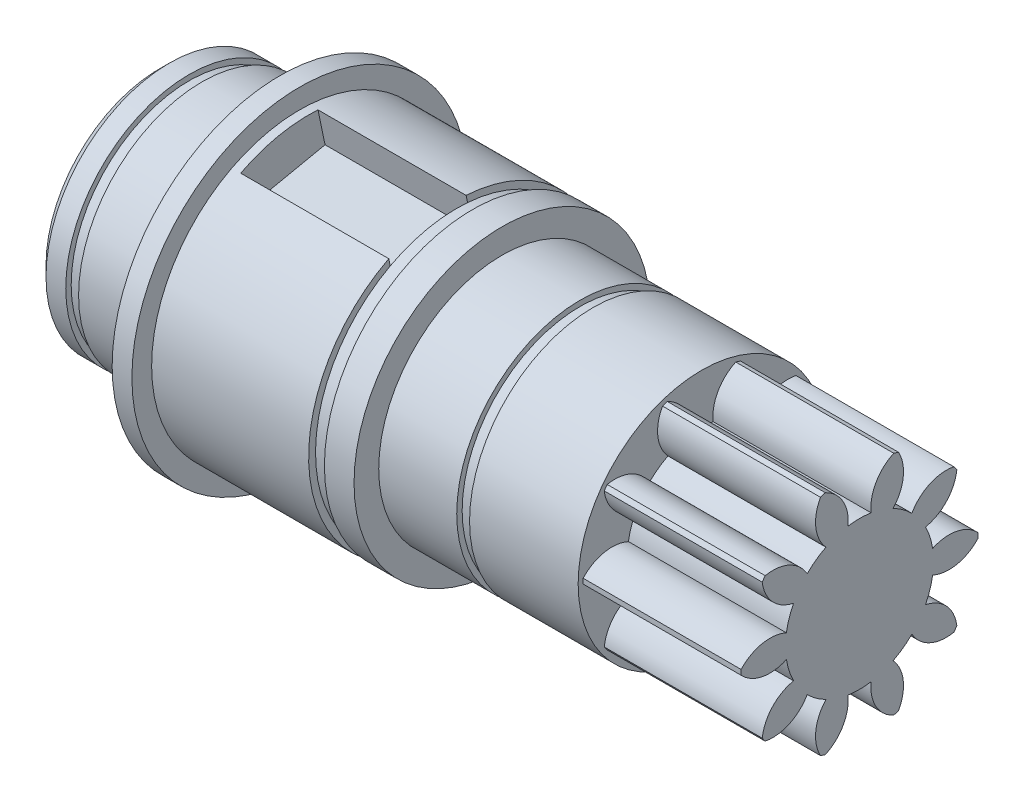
ISO-10303-21;
HEADER;
FILE_DESCRIPTION(('STEP AP214'),'2;1');
FILE_NAME('part.step','',(''),(''),'','','');
FILE_SCHEMA(('AUTOMOTIVE_DESIGN { 1 0 10303 214 1 1 1 1 }'));
ENDSEC;
DATA;
#1=APPLICATION_CONTEXT('core data for automotive mechanical design processes');
#2=APPLICATION_PROTOCOL_DEFINITION('international standard','automotive_design',2000,#1);
#3=PRODUCT_CONTEXT('',#1,'mechanical');
#4=PRODUCT('Part','Part','',(#3));
#5=PRODUCT_RELATED_PRODUCT_CATEGORY('part','',(#4));
#6=PRODUCT_DEFINITION_FORMATION('','',#4);
#7=PRODUCT_DEFINITION_CONTEXT('part definition',#1,'design');
#8=PRODUCT_DEFINITION('design','',#6,#7);
#9=PRODUCT_DEFINITION_SHAPE('','',#8);
#10=(LENGTH_UNIT() NAMED_UNIT(*) SI_UNIT(.MILLI.,.METRE.));
#11=(NAMED_UNIT(*) PLANE_ANGLE_UNIT() SI_UNIT($,.RADIAN.));
#12=(NAMED_UNIT(*) SI_UNIT($,.STERADIAN.) SOLID_ANGLE_UNIT());
#13=UNCERTAINTY_MEASURE_WITH_UNIT(LENGTH_MEASURE(1.E-05),#10,'distance_accuracy_value','');
#14=(GEOMETRIC_REPRESENTATION_CONTEXT(3) GLOBAL_UNCERTAINTY_ASSIGNED_CONTEXT((#13)) GLOBAL_UNIT_ASSIGNED_CONTEXT((#10,
#11,#12)) REPRESENTATION_CONTEXT('',''));
#15=CARTESIAN_POINT('',(0.,0.,0.));
#16=DIRECTION('',(0.,0.,1.));
#17=DIRECTION('',(1.,0.,0.));
#18=AXIS2_PLACEMENT_3D('',#15,#16,#17);
#19=CARTESIAN_POINT('',(-50.6,0.,0.));
#20=DIRECTION('',(-1.,0.,0.));
#21=DIRECTION('',(0.,0.,1.00000000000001));
#22=AXIS2_PLACEMENT_3D('',#19,#20,#21);
#23=PLANE('',#22);
#24=CARTESIAN_POINT('',(-50.6,0.,0.));
#25=DIRECTION('',(-1.,0.,0.));
#26=DIRECTION('',(0.,0.,1.00000000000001));
#27=AXIS2_PLACEMENT_3D('',#24,#25,#26);
#28=CIRCLE('',#27,12.5);
#29=CARTESIAN_POINT('',(-50.6,0.,12.5000000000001));
#30=VERTEX_POINT('',#29);
#31=EDGE_CURVE('E376',#30,#30,#28,.T.);
#32=ORIENTED_EDGE('',*,*,#31,.T.);
#33=EDGE_LOOP('',(#32));
#34=FACE_BOUND('',#33,.T.);
#35=CARTESIAN_POINT('',(-50.6,0.,0.));
#36=DIRECTION('',(-1.,0.,0.));
#37=DIRECTION('',(0.,0.,1.00000000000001));
#38=AXIS2_PLACEMENT_3D('',#35,#36,#37);
#39=CIRCLE('',#38,11.95);
#40=CARTESIAN_POINT('',(-50.6,0.,11.9500000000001));
#41=VERTEX_POINT('',#40);
#42=EDGE_CURVE('E369',#41,#41,#39,.T.);
#43=ORIENTED_EDGE('',*,*,#42,.F.);
#44=EDGE_LOOP('',(#43));
#45=FACE_BOUND('',#44,.T.);
#46=ADVANCED_FACE('F46',(#34,#45),#23,.T.);
#47=CARTESIAN_POINT('',(-42.7,0.,0.));
#48=DIRECTION('',(-1.,0.,0.));
#49=DIRECTION('',(0.,0.,1.00000000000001));
#50=AXIS2_PLACEMENT_3D('',#47,#48,#49);
#51=PLANE('',#50);
#52=CARTESIAN_POINT('',(-42.7,0.,0.));
#53=DIRECTION('',(-1.,0.,0.));
#54=DIRECTION('',(0.,0.,1.00000000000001));
#55=AXIS2_PLACEMENT_3D('',#52,#53,#54);
#56=CIRCLE('',#55,17.);
#57=CARTESIAN_POINT('',(-42.7,0.,17.0000000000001));
#58=VERTEX_POINT('',#57);
#59=EDGE_CURVE('E382',#58,#58,#56,.T.);
#60=ORIENTED_EDGE('',*,*,#59,.T.);
#61=EDGE_LOOP('',(#60));
#62=FACE_BOUND('',#61,.T.);
#63=CARTESIAN_POINT('',(-42.7,0.,0.));
#64=DIRECTION('',(-1.,0.,0.));
#65=DIRECTION('',(0.,0.,1.00000000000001));
#66=AXIS2_PLACEMENT_3D('',#63,#64,#65);
#67=CIRCLE('',#66,12.5);
#68=CARTESIAN_POINT('',(-42.7,0.,12.5000000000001));
#69=VERTEX_POINT('',#68);
#70=EDGE_CURVE('E373',#69,#69,#67,.T.);
#71=ORIENTED_EDGE('',*,*,#70,.F.);
#72=EDGE_LOOP('',(#71));
#73=FACE_BOUND('',#72,.T.);
#74=ADVANCED_FACE('F704',(#62,#73),#51,.T.);
#75=CARTESIAN_POINT('',(-23.1999999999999,0.,-4.02455846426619E-13));
#76=DIRECTION('',(-1.,0.,0.));
#77=DIRECTION('',(0.,0.,1.00000000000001));
#78=AXIS2_PLACEMENT_3D('',#75,#76,#77);
#79=PLANE('',#78);
#80=CARTESIAN_POINT('',(-23.1999999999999,0.,-4.02455846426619E-13));
#81=DIRECTION('',(-1.,0.,0.));
#82=DIRECTION('',(0.,0.,1.00000000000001));
#83=AXIS2_PLACEMENT_3D('',#80,#81,#82);
#84=CIRCLE('',#83,15.);
#85=CARTESIAN_POINT('',(-23.1999999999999,0.,14.9999999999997));
#86=VERTEX_POINT('',#85);
#87=EDGE_CURVE('E400',#86,#86,#84,.T.);
#88=ORIENTED_EDGE('',*,*,#87,.T.);
#89=EDGE_LOOP('',(#88));
#90=FACE_BOUND('',#89,.T.);
#91=CARTESIAN_POINT('',(-23.1999999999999,0.,-4.02455846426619E-13));
#92=DIRECTION('',(-1.,0.,0.));
#93=DIRECTION('',(0.,0.,1.00000000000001));
#94=AXIS2_PLACEMENT_3D('',#91,#92,#93);
#95=CIRCLE('',#94,14.3);
#96=CARTESIAN_POINT('',(-23.1999999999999,0.,14.2999999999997));
#97=VERTEX_POINT('',#96);
#98=EDGE_CURVE('E391',#97,#97,#95,.T.);
#99=ORIENTED_EDGE('',*,*,#98,.F.);
#100=EDGE_LOOP('',(#99));
#101=FACE_BOUND('',#100,.T.);
#102=ADVANCED_FACE('F710',(#90,#101),#79,.T.);
#103=CARTESIAN_POINT('',(-10.9999999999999,0.,0.));
#104=DIRECTION('',(-1.,0.,0.));
#105=DIRECTION('',(0.,0.,1.00000000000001));
#106=AXIS2_PLACEMENT_3D('',#103,#104,#105);
#107=PLANE('',#106);
#108=CARTESIAN_POINT('',(-10.9999999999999,0.,0.));
#109=DIRECTION('',(-1.,0.,0.));
#110=DIRECTION('',(0.,0.,1.00000000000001));
#111=AXIS2_PLACEMENT_3D('',#108,#109,#110);
#112=CIRCLE('',#111,12.5);
#113=CARTESIAN_POINT('',(-10.9999999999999,0.,12.5000000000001));
#114=VERTEX_POINT('',#113);
#115=EDGE_CURVE('E418',#114,#114,#112,.T.);
#116=ORIENTED_EDGE('',*,*,#115,.T.);
#117=EDGE_LOOP('',(#116));
#118=FACE_BOUND('',#117,.T.);
#119=CARTESIAN_POINT('',(-10.9999999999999,0.,0.));
#120=DIRECTION('',(-1.,0.,0.));
#121=DIRECTION('',(0.,0.,1.00000000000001));
#122=AXIS2_PLACEMENT_3D('',#119,#120,#121);
#123=CIRCLE('',#122,11.95);
#124=CARTESIAN_POINT('',(-10.9999999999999,0.,11.9500000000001));
#125=VERTEX_POINT('',#124);
#126=EDGE_CURVE('E409',#125,#125,#123,.T.);
#127=ORIENTED_EDGE('',*,*,#126,.F.);
#128=EDGE_LOOP('',(#127));
#129=FACE_BOUND('',#128,.T.);
#130=ADVANCED_FACE('F740',(#118,#129),#107,.T.);
#131=CARTESIAN_POINT('',(16.0000000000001,1.2490009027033E-13,-7.0082828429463E-13));
#132=DIRECTION('',(-1.,0.,0.));
#133=DIRECTION('',(0.,0.,1.00000000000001));
#134=AXIS2_PLACEMENT_3D('',#131,#132,#133);
#135=PLANE('',#134);
#136=CARTESIAN_POINT('',(16.,3.33434621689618,-8.78546284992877));
#137=DIRECTION('',(-1.,0.,0.));
#138=DIRECTION('',(0.,-0.587785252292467,-0.809016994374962));
#139=AXIS2_PLACEMENT_3D('',#136,#137,#138);
#140=CIRCLE('',#139,4.);
#141=CARTESIAN_POINT('',(16.0000000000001,5.30219236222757,-5.30299511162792));
#142=VERTEX_POINT('',#141);
#143=CARTESIAN_POINT('',(16.,7.25962702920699,-9.55498903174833));
#144=VERTEX_POINT('',#143);
#145=EDGE_CURVE('E424',#142,#144,#140,.T.);
#146=ORIENTED_EDGE('',*,*,#145,.F.);
#147=CARTESIAN_POINT('',(16.0000000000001,1.2490009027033E-13,-7.0082828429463E-13));
#148=DIRECTION('',(-1.,0.,0.));
#149=DIRECTION('',(0.,-0.587785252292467,-0.809016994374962));
#150=AXIS2_PLACEMENT_3D('',#147,#148,#149);
#151=CIRCLE('',#150,7.499);
#152=CARTESIAN_POINT('',(16.0000000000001,6.68191560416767,-3.40396898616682));
#153=VERTEX_POINT('',#152);
#154=EDGE_CURVE('E429',#153,#142,#151,.T.);
#155=ORIENTED_EDGE('',*,*,#154,.F.);
#156=CARTESIAN_POINT('',(16.0000000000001,9.38584133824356,-0.456294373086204));
#157=DIRECTION('',(-1.,0.,0.));
#158=DIRECTION('',(0.,-0.587785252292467,-0.809016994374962));
#159=AXIS2_PLACEMENT_3D('',#156,#157,#158);
#160=CIRCLE('',#159,4.);
#161=CARTESIAN_POINT('',(16.0000000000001,11.3306827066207,-3.95166160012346));
#162=VERTEX_POINT('',#161);
#163=EDGE_CURVE('E426',#162,#153,#160,.T.);
#164=ORIENTED_EDGE('',*,*,#163,.F.);
#165=CARTESIAN_POINT('',(16.0000000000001,1.2490009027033E-13,-7.0082828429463E-13));
#166=DIRECTION('',(-1.,0.,0.));
#167=DIRECTION('',(0.,0.,1.00000000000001));
#168=AXIS2_PLACEMENT_3D('',#165,#166,#167);
#169=CIRCLE('',#168,12.);
#170=CARTESIAN_POINT('',(16.0000000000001,11.489443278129,-3.46304680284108));
#171=VERTEX_POINT('',#170);
#172=EDGE_CURVE('E644',#171,#162,#169,.T.);
#173=ORIENTED_EDGE('',*,*,#172,.F.);
#174=CARTESIAN_POINT('',(16.,7.86150825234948,-5.14770921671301));
#175=DIRECTION('',(-1.,0.,0.));
#176=DIRECTION('',(0.,0.,-1.00000000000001));
#177=AXIS2_PLACEMENT_3D('',#174,#175,#176);
#178=CIRCLE('',#177,4.);
#179=CARTESIAN_POINT('',(16.0000000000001,7.40658604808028,-1.17366269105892));
#180=VERTEX_POINT('',#179);
#181=EDGE_CURVE('E622',#180,#171,#178,.T.);
#182=ORIENTED_EDGE('',*,*,#181,.F.);
#183=CARTESIAN_POINT('',(16.0000000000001,1.2490009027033E-13,-7.0082828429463E-13));
#184=DIRECTION('',(-1.,0.,0.));
#185=DIRECTION('',(0.,0.,-1.00000000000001));
#186=AXIS2_PLACEMENT_3D('',#183,#184,#185);
#187=CIRCLE('',#186,7.499);
#188=CARTESIAN_POINT('',(16.0000000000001,7.40658604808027,1.17366269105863));
#189=VERTEX_POINT('',#188);
#190=EDGE_CURVE('E626',#189,#180,#187,.T.);
#191=ORIENTED_EDGE('',*,*,#190,.F.);
#192=CARTESIAN_POINT('',(16.0000000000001,7.86150825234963,5.14770921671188));
#193=DIRECTION('',(-1.,0.,0.));
#194=DIRECTION('',(0.,0.,-1.00000000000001));
#195=AXIS2_PLACEMENT_3D('',#192,#193,#194);
#196=CIRCLE('',#195,4.);
#197=CARTESIAN_POINT('',(16.0000000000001,11.4894432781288,3.46304680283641));
#198=VERTEX_POINT('',#197);
#199=EDGE_CURVE('E624',#198,#189,#196,.T.);
#200=ORIENTED_EDGE('',*,*,#199,.F.);
#201=CARTESIAN_POINT('',(16.0000000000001,11.3306827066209,3.95166160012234));
#202=VERTEX_POINT('',#201);
#203=EDGE_CURVE('E642',#202,#198,#169,.T.);
#204=ORIENTED_EDGE('',*,*,#203,.F.);
#205=CARTESIAN_POINT('',(16.0000000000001,9.3858413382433,0.45629437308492));
#206=DIRECTION('',(-1.,0.,0.));
#207=DIRECTION('',(0.,0.587785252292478,-0.809016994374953));
#208=AXIS2_PLACEMENT_3D('',#205,#206,#207);
#209=CIRCLE('',#208,4.);
#210=CARTESIAN_POINT('',(16.0000000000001,6.681915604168,3.40396898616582));
#211=VERTEX_POINT('',#210);
#212=EDGE_CURVE('E595',#211,#202,#209,.T.);
#213=ORIENTED_EDGE('',*,*,#212,.F.);
#214=CARTESIAN_POINT('',(16.0000000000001,1.2490009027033E-13,-7.0082828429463E-13));
#215=DIRECTION('',(-1.,0.,0.));
#216=DIRECTION('',(0.,0.587785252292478,-0.809016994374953));
#217=AXIS2_PLACEMENT_3D('',#214,#215,#216);
#218=CIRCLE('',#217,7.499);
#219=CARTESIAN_POINT('',(16.0000000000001,5.30219236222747,5.30299511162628));
#220=VERTEX_POINT('',#219);
#221=EDGE_CURVE('E600',#220,#211,#218,.T.);
#222=ORIENTED_EDGE('',*,*,#221,.F.);
#223=CARTESIAN_POINT('',(16.0000000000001,3.33434621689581,8.78546284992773));
#224=DIRECTION('',(-1.,0.,0.));
#225=DIRECTION('',(0.,0.587785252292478,-0.809016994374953));
#226=AXIS2_PLACEMENT_3D('',#223,#224,#225);
#227=CIRCLE('',#226,4.);
#228=CARTESIAN_POINT('',(16.0000000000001,7.25962702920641,9.55498903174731));
#229=VERTEX_POINT('',#228);
#230=EDGE_CURVE('E597',#229,#220,#227,.T.);
#231=ORIENTED_EDGE('',*,*,#230,.F.);
#232=CARTESIAN_POINT('',(16.0000000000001,6.84398645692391,9.85696958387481));
#233=VERTEX_POINT('',#232);
#234=EDGE_CURVE('E1042',#233,#229,#169,.T.);
#235=ORIENTED_EDGE('',*,*,#234,.F.);
#236=CARTESIAN_POINT('',(16.0000000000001,7.3251020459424,5.88600902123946));
#237=DIRECTION('',(-1.,0.,0.));
#238=DIRECTION('',(0.,0.951056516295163,-0.309016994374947));
#239=AXIS2_PLACEMENT_3D('',#236,#237,#238);
#240=CIRCLE('',#239,4.);
#241=CARTESIAN_POINT('',(16.0000000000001,3.4049805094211,6.68140020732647));
#242=VERTEX_POINT('',#241);
#243=EDGE_CURVE('E573',#242,#233,#240,.T.);
#244=ORIENTED_EDGE('',*,*,#243,.F.);
#245=CARTESIAN_POINT('',(16.0000000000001,1.2490009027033E-13,-7.0082828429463E-13));
#246=DIRECTION('',(-1.,0.,0.));
#247=DIRECTION('',(0.,0.951056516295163,-0.309016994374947));
#248=AXIS2_PLACEMENT_3D('',#245,#246,#247);
#249=CIRCLE('',#248,7.499);
#250=CARTESIAN_POINT('',(16.0000000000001,1.17254140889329,7.4067636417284));
#251=VERTEX_POINT('',#250);
#252=EDGE_CURVE('E578',#251,#242,#249,.T.);
#253=ORIENTED_EDGE('',*,*,#252,.F.);
#254=CARTESIAN_POINT('',(16.0000000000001,-2.46642274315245,9.06746828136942));
#255=DIRECTION('',(-1.,0.,0.));
#256=DIRECTION('',(0.,0.951056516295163,-0.309016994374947));
#257=AXIS2_PLACEMENT_3D('',#254,#255,#256);
#258=CIRCLE('',#257,4.);
#259=CARTESIAN_POINT('',(16.0000000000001,0.25688000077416,11.9972502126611));
#260=VERTEX_POINT('',#259);
#261=EDGE_CURVE('E575',#260,#251,#258,.T.);
#262=ORIENTED_EDGE('',*,*,#261,.F.);
#263=CARTESIAN_POINT('',(16.0000000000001,-0.256880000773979,11.9972502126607));
#264=VERTEX_POINT('',#263);
#265=EDGE_CURVE('E1031',#264,#260,#169,.T.);
#266=ORIENTED_EDGE('',*,*,#265,.F.);
#267=CARTESIAN_POINT('',(16.0000000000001,2.46642274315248,9.0674682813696));
#268=DIRECTION('',(-1.,0.,0.));
#269=DIRECTION('',(0.,0.951056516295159,0.309016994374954));
#270=AXIS2_PLACEMENT_3D('',#267,#268,#269);
#271=CIRCLE('',#270,4.);
#272=CARTESIAN_POINT('',(16.0000000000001,-1.1725414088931,7.406763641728));
#273=VERTEX_POINT('',#272);
#274=EDGE_CURVE('E551',#273,#264,#271,.T.);
#275=ORIENTED_EDGE('',*,*,#274,.F.);
#276=CARTESIAN_POINT('',(16.0000000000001,1.2490009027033E-13,-7.0082828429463E-13));
#277=DIRECTION('',(-1.,0.,0.));
#278=DIRECTION('',(0.,0.951056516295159,0.309016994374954));
#279=AXIS2_PLACEMENT_3D('',#276,#277,#278);
#280=CIRCLE('',#279,7.499);
#281=CARTESIAN_POINT('',(16.0000000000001,-3.40498050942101,6.6814002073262));
#282=VERTEX_POINT('',#281);
#283=EDGE_CURVE('E556',#282,#273,#280,.T.);
#284=ORIENTED_EDGE('',*,*,#283,.F.);
#285=CARTESIAN_POINT('',(16.0000000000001,-7.32510204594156,5.88600902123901));
#286=DIRECTION('',(-1.,0.,0.));
#287=DIRECTION('',(0.,0.951056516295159,0.309016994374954));
#288=AXIS2_PLACEMENT_3D('',#285,#286,#287);
#289=CIRCLE('',#288,4.);
#290=CARTESIAN_POINT('',(16.0000000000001,-6.84398645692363,9.85696958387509));
#291=VERTEX_POINT('',#290);
#292=EDGE_CURVE('E553',#291,#282,#289,.T.);
#293=ORIENTED_EDGE('',*,*,#292,.F.);
#294=CARTESIAN_POINT('',(16.0000000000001,-7.25962702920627,9.55498903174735));
#295=VERTEX_POINT('',#294);
#296=EDGE_CURVE('E1019',#295,#291,#169,.T.);
#297=ORIENTED_EDGE('',*,*,#296,.F.);
#298=CARTESIAN_POINT('',(16.0000000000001,-3.3343462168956,8.78546284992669));
#299=DIRECTION('',(-1.,0.,0.));
#300=DIRECTION('',(0.,0.587785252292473,0.809016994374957));
#301=AXIS2_PLACEMENT_3D('',#298,#299,#300);
#302=CIRCLE('',#301,4.);
#303=CARTESIAN_POINT('',(16.0000000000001,-5.30219236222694,5.30299511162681));
#304=VERTEX_POINT('',#303);
#305=EDGE_CURVE('E529',#304,#295,#302,.T.);
#306=ORIENTED_EDGE('',*,*,#305,.F.);
#307=CARTESIAN_POINT('',(16.0000000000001,1.2490009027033E-13,-7.0082828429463E-13));
#308=DIRECTION('',(-1.,0.,0.));
#309=DIRECTION('',(0.,0.587785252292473,0.809016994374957));
#310=AXIS2_PLACEMENT_3D('',#307,#308,#309);
#311=CIRCLE('',#310,7.499);
#312=CARTESIAN_POINT('',(16.0000000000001,-6.6819156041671,3.40396898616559));
#313=VERTEX_POINT('',#312);
#314=EDGE_CURVE('E534',#313,#304,#311,.T.);
#315=ORIENTED_EDGE('',*,*,#314,.F.);
#316=CARTESIAN_POINT('',(16.0000000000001,-9.38584133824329,0.456294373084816));
#317=DIRECTION('',(-1.,0.,0.));
#318=DIRECTION('',(0.,0.587785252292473,0.809016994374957));
#319=AXIS2_PLACEMENT_3D('',#316,#317,#318);
#320=CIRCLE('',#319,4.);
#321=CARTESIAN_POINT('',(16.0000000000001,-11.3306827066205,3.95166160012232));
#322=VERTEX_POINT('',#321);
#323=EDGE_CURVE('E531',#322,#313,#320,.T.);
#324=ORIENTED_EDGE('',*,*,#323,.F.);
#325=CARTESIAN_POINT('',(16.0000000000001,-11.4894432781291,3.46304680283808));
#326=VERTEX_POINT('',#325);
#327=EDGE_CURVE('E1007',#326,#322,#169,.T.);
#328=ORIENTED_EDGE('',*,*,#327,.F.);
#329=CARTESIAN_POINT('',(16.0000000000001,-7.86150825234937,5.14770921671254));
#330=DIRECTION('',(-1.,0.,0.));
#331=DIRECTION('',(0.,0.,1.00000000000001));
#332=AXIS2_PLACEMENT_3D('',#329,#330,#331);
#333=CIRCLE('',#332,4.);
#334=CARTESIAN_POINT('',(16.0000000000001,-7.40658604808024,1.1736626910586));
#335=VERTEX_POINT('',#334);
#336=EDGE_CURVE('E507',#335,#326,#333,.T.);
#337=ORIENTED_EDGE('',*,*,#336,.F.);
#338=CARTESIAN_POINT('',(16.0000000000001,1.2490009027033E-13,-7.0082828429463E-13));
#339=DIRECTION('',(-1.,0.,0.));
#340=DIRECTION('',(0.,0.,1.00000000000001));
#341=AXIS2_PLACEMENT_3D('',#338,#339,#340);
#342=CIRCLE('',#341,7.499);
#343=CARTESIAN_POINT('',(16.0000000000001,-7.40658604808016,-1.17366269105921));
#344=VERTEX_POINT('',#343);
#345=EDGE_CURVE('E512',#344,#335,#342,.T.);
#346=ORIENTED_EDGE('',*,*,#345,.F.);
#347=CARTESIAN_POINT('',(16.0000000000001,-7.86150825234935,-5.14770921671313));
#348=DIRECTION('',(-1.,0.,0.));
#349=DIRECTION('',(0.,0.,1.00000000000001));
#350=AXIS2_PLACEMENT_3D('',#347,#348,#349);
#351=CIRCLE('',#350,4.);
#352=CARTESIAN_POINT('',(16.0000000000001,-11.4894432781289,-3.46304680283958));
#353=VERTEX_POINT('',#352);
#354=EDGE_CURVE('E509',#353,#344,#351,.T.);
#355=ORIENTED_EDGE('',*,*,#354,.F.);
#356=CARTESIAN_POINT('',(16.0000000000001,-11.3306827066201,-3.95166160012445));
#357=VERTEX_POINT('',#356);
#358=EDGE_CURVE('E995',#357,#353,#169,.T.);
#359=ORIENTED_EDGE('',*,*,#358,.F.);
#360=CARTESIAN_POINT('',(16.0000000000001,-9.38584133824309,-0.456294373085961));
#361=DIRECTION('',(-1.,0.,0.));
#362=DIRECTION('',(0.,-0.587785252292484,0.809016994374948));
#363=AXIS2_PLACEMENT_3D('',#360,#361,#362);
#364=CIRCLE('',#363,4.);
#365=CARTESIAN_POINT('',(16.0000000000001,-6.68191560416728,-3.40396898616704));
#366=VERTEX_POINT('',#365);
#367=EDGE_CURVE('E485',#366,#357,#364,.T.);
#368=ORIENTED_EDGE('',*,*,#367,.F.);
#369=CARTESIAN_POINT('',(16.0000000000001,1.2490009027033E-13,-7.0082828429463E-13));
#370=DIRECTION('',(-1.,0.,0.));
#371=DIRECTION('',(0.,-0.587785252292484,0.809016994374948));
#372=AXIS2_PLACEMENT_3D('',#369,#370,#371);
#373=CIRCLE('',#372,7.499);
#374=CARTESIAN_POINT('',(16.0000000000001,-5.30219236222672,-5.30299511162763));
#375=VERTEX_POINT('',#374);
#376=EDGE_CURVE('E490',#375,#366,#373,.T.);
#377=ORIENTED_EDGE('',*,*,#376,.F.);
#378=CARTESIAN_POINT('',(16.,-3.3343462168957,-8.78546284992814));
#379=DIRECTION('',(-1.,0.,0.));
#380=DIRECTION('',(0.,-0.587785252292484,0.809016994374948));
#381=AXIS2_PLACEMENT_3D('',#378,#379,#380);
#382=CIRCLE('',#381,4.);
#383=CARTESIAN_POINT('',(16.,-7.25962702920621,-9.55498903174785));
#384=VERTEX_POINT('',#383);
#385=EDGE_CURVE('E487',#384,#375,#382,.T.);
#386=ORIENTED_EDGE('',*,*,#385,.F.);
#387=CARTESIAN_POINT('',(16.,-6.84398645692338,-9.85696958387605));
#388=VERTEX_POINT('',#387);
#389=EDGE_CURVE('E983',#388,#384,#169,.T.);
#390=ORIENTED_EDGE('',*,*,#389,.F.);
#391=CARTESIAN_POINT('',(16.0000000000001,-7.32510204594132,-5.8860090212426));
#392=DIRECTION('',(-1.,0.,0.));
#393=DIRECTION('',(0.,-0.951056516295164,0.30901699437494));
#394=AXIS2_PLACEMENT_3D('',#391,#392,#393);
#395=CIRCLE('',#394,4.);
#396=CARTESIAN_POINT('',(16.0000000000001,-3.40498050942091,-6.68140020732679));
#397=VERTEX_POINT('',#396);
#398=EDGE_CURVE('E463',#397,#388,#395,.T.);
#399=ORIENTED_EDGE('',*,*,#398,.F.);
#400=CARTESIAN_POINT('',(16.0000000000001,1.2490009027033E-13,-7.0082828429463E-13));
#401=DIRECTION('',(-1.,0.,0.));
#402=DIRECTION('',(0.,-0.951056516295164,0.30901699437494));
#403=AXIS2_PLACEMENT_3D('',#400,#401,#402);
#404=CIRCLE('',#403,7.499);
#405=CARTESIAN_POINT('',(16.,-1.17254140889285,-7.40676364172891));
#406=VERTEX_POINT('',#405);
#407=EDGE_CURVE('E468',#406,#397,#404,.T.);
#408=ORIENTED_EDGE('',*,*,#407,.F.);
#409=CARTESIAN_POINT('',(16.,2.46642274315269,-9.06746828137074));
#410=DIRECTION('',(-1.,0.,0.));
#411=DIRECTION('',(0.,-0.951056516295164,0.30901699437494));
#412=AXIS2_PLACEMENT_3D('',#409,#410,#411);
#413=CIRCLE('',#412,4.);
#414=CARTESIAN_POINT('',(16.,-0.256880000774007,-11.9972502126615));
#415=VERTEX_POINT('',#414);
#416=EDGE_CURVE('E465',#415,#406,#413,.T.);
#417=ORIENTED_EDGE('',*,*,#416,.F.);
#418=CARTESIAN_POINT('',(16.,0.256880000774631,-11.9972502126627));
#419=VERTEX_POINT('',#418);
#420=EDGE_CURVE('E970',#419,#415,#169,.T.);
#421=ORIENTED_EDGE('',*,*,#420,.F.);
#422=CARTESIAN_POINT('',(16.,-2.46642274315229,-9.06746828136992));
#423=DIRECTION('',(-1.,0.,0.));
#424=DIRECTION('',(0.,-0.951056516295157,-0.30901699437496));
#425=AXIS2_PLACEMENT_3D('',#422,#423,#424);
#426=CIRCLE('',#425,4.);
#427=CARTESIAN_POINT('',(16.,1.17254140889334,-7.4067636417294));
#428=VERTEX_POINT('',#427);
#429=EDGE_CURVE('E443',#428,#419,#426,.T.);
#430=ORIENTED_EDGE('',*,*,#429,.F.);
#431=CARTESIAN_POINT('',(16.0000000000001,1.2490009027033E-13,-7.0082828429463E-13));
#432=DIRECTION('',(-1.,0.,0.));
#433=DIRECTION('',(0.,-0.951056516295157,-0.30901699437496));
#434=AXIS2_PLACEMENT_3D('',#431,#432,#433);
#435=CIRCLE('',#434,7.499);
#436=CARTESIAN_POINT('',(16.,3.40498050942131,-6.68140020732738));
#437=VERTEX_POINT('',#436);
#438=EDGE_CURVE('E448',#437,#428,#435,.T.);
#439=ORIENTED_EDGE('',*,*,#438,.F.);
#440=CARTESIAN_POINT('',(16.,7.32510204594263,-5.88600902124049));
#441=DIRECTION('',(-1.,0.,0.));
#442=DIRECTION('',(0.,-0.951056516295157,-0.30901699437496));
#443=AXIS2_PLACEMENT_3D('',#440,#441,#442);
#444=CIRCLE('',#443,4.);
#445=CARTESIAN_POINT('',(16.,6.84398645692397,-9.85696958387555));
#446=VERTEX_POINT('',#445);
#447=EDGE_CURVE('E445',#446,#437,#444,.T.);
#448=ORIENTED_EDGE('',*,*,#447,.F.);
#449=EDGE_CURVE('E648',#144,#446,#169,.T.);
#450=ORIENTED_EDGE('',*,*,#449,.F.);
#451=EDGE_LOOP('',(#146,#155,#164,#173,#182,#191,#200,#204,#213,#222,#231,#235,#244,#253,#262,
#266,#275,#284,#293,#297,#306,#315,#324,#328,#337,#346,#355,#359,#368,#377,#386,#390,#399,#408,
#417,#421,#430,#439,#448,#450));
#452=FACE_BOUND('',#451,.T.);
#453=ADVANCED_FACE('F764',(#452),#135,.F.);
#454=CARTESIAN_POINT('',(-9.99999999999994,0.,0.));
#455=DIRECTION('',(-1.,0.,0.));
#456=DIRECTION('',(0.,0.,1.00000000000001));
#457=AXIS2_PLACEMENT_3D('',#454,#455,#456);
#458=CYLINDRICAL_SURFACE('',#457,12.);
#459=DIRECTION('',(-1.,0.,0.));
#460=VECTOR('',#459,1.);
#461=CARTESIAN_POINT('',(8.,7.25962702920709,-9.55498903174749));
#462=LINE('',#461,#460);
#463=CARTESIAN_POINT('',(0.,7.25962702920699,-9.55498903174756));
#464=VERTEX_POINT('',#463);
#465=EDGE_CURVE('E441',#144,#464,#462,.T.);
#466=ORIENTED_EDGE('',*,*,#465,.F.);
#467=ORIENTED_EDGE('',*,*,#449,.T.);
#468=DIRECTION('',(-1.,0.,0.));
#469=VECTOR('',#468,1.);
#470=CARTESIAN_POINT('',(8.,6.84398645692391,-9.85696958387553));
#471=LINE('',#470,#469);
#472=CARTESIAN_POINT('',(0.,6.84398645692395,-9.85696958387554));
#473=VERTEX_POINT('',#472);
#474=EDGE_CURVE('E457',#473,#446,#471,.F.);
#475=ORIENTED_EDGE('',*,*,#474,.F.);
#476=CARTESIAN_POINT('',(1.2490009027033E-13,0.,0.));
#477=DIRECTION('',(-1.,0.,0.));
#478=DIRECTION('',(0.,0.,1.00000000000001));
#479=AXIS2_PLACEMENT_3D('',#476,#477,#478);
#480=CIRCLE('',#479,12.);
#481=EDGE_CURVE('E643',#464,#473,#480,.T.);
#482=ORIENTED_EDGE('',*,*,#481,.F.);
#483=EDGE_LOOP('',(#466,#467,#475,#482));
#484=FACE_BOUND('',#483,.T.);
#485=ADVANCED_FACE('F896',(#484),#458,.T.);
#486=DIRECTION('',(-1.,0.,0.));
#487=VECTOR('',#486,1.);
#488=CARTESIAN_POINT('',(8.00000000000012,11.3306827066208,-3.95166160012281));
#489=LINE('',#488,#487);
#490=CARTESIAN_POINT('',(1.2490009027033E-13,11.3306827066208,-3.95166160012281));
#491=VERTEX_POINT('',#490);
#492=EDGE_CURVE('E439',#491,#162,#489,.F.);
#493=ORIENTED_EDGE('',*,*,#492,.F.);
#494=CARTESIAN_POINT('',(1.12410081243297E-12,11.4894432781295,-3.4630468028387));
#495=VERTEX_POINT('',#494);
#496=EDGE_CURVE('E639',#495,#491,#480,.T.);
#497=ORIENTED_EDGE('',*,*,#496,.F.);
#498=DIRECTION('',(-1.,0.,0.));
#499=VECTOR('',#498,1.);
#500=CARTESIAN_POINT('',(8.00000000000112,11.4894432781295,-3.4630468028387));
#501=LINE('',#500,#499);
#502=EDGE_CURVE('E636',#171,#495,#501,.T.);
#503=ORIENTED_EDGE('',*,*,#502,.F.);
#504=ORIENTED_EDGE('',*,*,#172,.T.);
#505=EDGE_LOOP('',(#493,#497,#503,#504));
#506=FACE_BOUND('',#505,.T.);
#507=ADVANCED_FACE('F902',(#506),#458,.T.);
#508=DIRECTION('',(-1.,0.,0.));
#509=VECTOR('',#508,1.);
#510=CARTESIAN_POINT('',(8.,0.25688000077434,-11.9972502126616));
#511=LINE('',#510,#509);
#512=CARTESIAN_POINT('',(0.,0.256880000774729,-11.9972502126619));
#513=VERTEX_POINT('',#512);
#514=EDGE_CURVE('E460',#419,#513,#511,.T.);
#515=ORIENTED_EDGE('',*,*,#514,.F.);
#516=ORIENTED_EDGE('',*,*,#420,.T.);
#517=DIRECTION('',(-1.,0.,0.));
#518=VECTOR('',#517,1.);
#519=CARTESIAN_POINT('',(8.,-0.256880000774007,-11.9972502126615));
#520=LINE('',#519,#518);
#521=CARTESIAN_POINT('',(0.,-0.256880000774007,-11.9972502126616));
#522=VERTEX_POINT('',#521);
#523=EDGE_CURVE('E479',#522,#415,#520,.F.);
#524=ORIENTED_EDGE('',*,*,#523,.F.);
#525=EDGE_CURVE('E916',#513,#522,#480,.T.);
#526=ORIENTED_EDGE('',*,*,#525,.F.);
#527=EDGE_LOOP('',(#515,#516,#524,#526));
#528=FACE_BOUND('',#527,.T.);
#529=ADVANCED_FACE('F968',(#528),#458,.T.);
#530=DIRECTION('',(-1.,0.,0.));
#531=VECTOR('',#530,1.);
#532=CARTESIAN_POINT('',(8.,-6.84398645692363,-9.85696958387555));
#533=LINE('',#532,#531);
#534=CARTESIAN_POINT('',(0.,-6.84398645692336,-9.85696958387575));
#535=VERTEX_POINT('',#534);
#536=EDGE_CURVE('E482',#388,#535,#533,.T.);
#537=ORIENTED_EDGE('',*,*,#536,.F.);
#538=ORIENTED_EDGE('',*,*,#389,.T.);
#539=DIRECTION('',(-1.,0.,0.));
#540=VECTOR('',#539,1.);
#541=CARTESIAN_POINT('',(8.00000000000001,-7.25962702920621,-9.55498903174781));
#542=LINE('',#541,#540);
#543=CARTESIAN_POINT('',(9.99200722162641E-13,-7.25962702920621,-9.55498903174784));
#544=VERTEX_POINT('',#543);
#545=EDGE_CURVE('E501',#544,#384,#542,.F.);
#546=ORIENTED_EDGE('',*,*,#545,.F.);
#547=EDGE_CURVE('E956',#535,#544,#480,.T.);
#548=ORIENTED_EDGE('',*,*,#547,.F.);
#549=EDGE_LOOP('',(#537,#538,#546,#548));
#550=FACE_BOUND('',#549,.T.);
#551=ADVANCED_FACE('F982',(#550),#458,.T.);
#552=DIRECTION('',(-1.,0.,0.));
#553=VECTOR('',#552,1.);
#554=CARTESIAN_POINT('',(8.00000000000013,-11.3306827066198,-3.95166160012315));
#555=LINE('',#554,#553);
#556=CARTESIAN_POINT('',(1.2490009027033E-13,-11.3306827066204,-3.95166160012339));
#557=VERTEX_POINT('',#556);
#558=EDGE_CURVE('E504',#357,#557,#555,.T.);
#559=ORIENTED_EDGE('',*,*,#558,.F.);
#560=ORIENTED_EDGE('',*,*,#358,.T.);
#561=DIRECTION('',(-1.,0.,0.));
#562=VECTOR('',#561,1.);
#563=CARTESIAN_POINT('',(8.00000000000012,-11.4894432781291,-3.463046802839));
#564=LINE('',#563,#562);
#565=CARTESIAN_POINT('',(1.2490009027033E-13,-11.4894432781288,-3.46304680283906));
#566=VERTEX_POINT('',#565);
#567=EDGE_CURVE('E523',#566,#353,#564,.F.);
#568=ORIENTED_EDGE('',*,*,#567,.F.);
#569=EDGE_CURVE('E952',#557,#566,#480,.T.);
#570=ORIENTED_EDGE('',*,*,#569,.F.);
#571=EDGE_LOOP('',(#559,#560,#568,#570));
#572=FACE_BOUND('',#571,.T.);
#573=ADVANCED_FACE('F994',(#572),#458,.T.);
#574=DIRECTION('',(-1.,0.,0.));
#575=VECTOR('',#574,1.);
#576=CARTESIAN_POINT('',(8.00000000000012,-11.489443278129,3.46304680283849));
#577=LINE('',#576,#575);
#578=CARTESIAN_POINT('',(1.2490009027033E-13,-11.4894432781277,3.46304680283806));
#579=VERTEX_POINT('',#578);
#580=EDGE_CURVE('E526',#326,#579,#577,.T.);
#581=ORIENTED_EDGE('',*,*,#580,.F.);
#582=ORIENTED_EDGE('',*,*,#327,.T.);
#583=DIRECTION('',(-1.,0.,0.));
#584=VECTOR('',#583,1.);
#585=CARTESIAN_POINT('',(8.00000000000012,-11.3306827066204,3.95166160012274));
#586=LINE('',#585,#584);
#587=CARTESIAN_POINT('',(1.2490009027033E-13,-11.3306827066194,3.95166160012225));
#588=VERTEX_POINT('',#587);
#589=EDGE_CURVE('E545',#588,#322,#586,.F.);
#590=ORIENTED_EDGE('',*,*,#589,.F.);
#591=EDGE_CURVE('E948',#579,#588,#480,.T.);
#592=ORIENTED_EDGE('',*,*,#591,.F.);
#593=EDGE_LOOP('',(#581,#582,#590,#592));
#594=FACE_BOUND('',#593,.T.);
#595=ADVANCED_FACE('F1006',(#594),#458,.T.);
#596=DIRECTION('',(-1.,0.,0.));
#597=VECTOR('',#596,1.);
#598=CARTESIAN_POINT('',(8.00000000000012,-7.25962702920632,9.5549890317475));
#599=LINE('',#598,#597);
#600=CARTESIAN_POINT('',(1.2490009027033E-13,-7.25962702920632,9.55498903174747));
#601=VERTEX_POINT('',#600);
#602=EDGE_CURVE('E548',#295,#601,#599,.T.);
#603=ORIENTED_EDGE('',*,*,#602,.F.);
#604=ORIENTED_EDGE('',*,*,#296,.T.);
#605=DIRECTION('',(-1.,0.,0.));
#606=VECTOR('',#605,1.);
#607=CARTESIAN_POINT('',(8.00000000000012,-6.84398645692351,9.85696958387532));
#608=LINE('',#607,#606);
#609=CARTESIAN_POINT('',(1.2490009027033E-13,-6.84398645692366,9.85696958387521));
#610=VERTEX_POINT('',#609);
#611=EDGE_CURVE('E567',#610,#291,#608,.F.);
#612=ORIENTED_EDGE('',*,*,#611,.F.);
#613=EDGE_CURVE('E944',#601,#610,#480,.T.);
#614=ORIENTED_EDGE('',*,*,#613,.F.);
#615=EDGE_LOOP('',(#603,#604,#612,#614));
#616=FACE_BOUND('',#615,.T.);
#617=ADVANCED_FACE('F1018',(#616),#458,.T.);
#618=DIRECTION('',(-1.,0.,0.));
#619=VECTOR('',#618,1.);
#620=CARTESIAN_POINT('',(8.00000000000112,-0.256880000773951,11.9972502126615));
#621=LINE('',#620,#619);
#622=CARTESIAN_POINT('',(1.12410081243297E-12,-0.256880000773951,11.9972502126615));
#623=VERTEX_POINT('',#622);
#624=EDGE_CURVE('E570',#264,#623,#621,.T.);
#625=ORIENTED_EDGE('',*,*,#624,.F.);
#626=ORIENTED_EDGE('',*,*,#265,.T.);
#627=DIRECTION('',(-1.,0.,0.));
#628=VECTOR('',#627,1.);
#629=CARTESIAN_POINT('',(8.00000000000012,0.256880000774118,11.9972502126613));
#630=LINE('',#629,#628);
#631=CARTESIAN_POINT('',(1.2490009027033E-13,0.25688000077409,11.9972502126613));
#632=VERTEX_POINT('',#631);
#633=EDGE_CURVE('E589',#632,#260,#630,.F.);
#634=ORIENTED_EDGE('',*,*,#633,.F.);
#635=EDGE_CURVE('E940',#623,#632,#480,.T.);
#636=ORIENTED_EDGE('',*,*,#635,.F.);
#637=EDGE_LOOP('',(#625,#626,#634,#636));
#638=FACE_BOUND('',#637,.T.);
#639=ADVANCED_FACE('F1030',(#638),#458,.T.);
#640=DIRECTION('',(-1.,0.,0.));
#641=VECTOR('',#640,1.);
#642=CARTESIAN_POINT('',(8.00000000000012,6.84398645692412,9.85696958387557));
#643=LINE('',#642,#641);
#644=CARTESIAN_POINT('',(1.2490009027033E-13,6.84398645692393,9.85696958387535));
#645=VERTEX_POINT('',#644);
#646=EDGE_CURVE('E592',#233,#645,#643,.T.);
#647=ORIENTED_EDGE('',*,*,#646,.F.);
#648=ORIENTED_EDGE('',*,*,#234,.T.);
#649=DIRECTION('',(-1.,0.,0.));
#650=VECTOR('',#649,1.);
#651=CARTESIAN_POINT('',(8.00000000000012,7.2596270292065,9.55498903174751));
#652=LINE('',#651,#650);
#653=CARTESIAN_POINT('',(1.2490009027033E-13,7.2596270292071,9.55498903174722));
#654=VERTEX_POINT('',#653);
#655=EDGE_CURVE('E611',#654,#229,#652,.F.);
#656=ORIENTED_EDGE('',*,*,#655,.F.);
#657=EDGE_CURVE('E938',#645,#654,#480,.T.);
#658=ORIENTED_EDGE('',*,*,#657,.F.);
#659=EDGE_LOOP('',(#647,#648,#656,#658));
#660=FACE_BOUND('',#659,.T.);
#661=ADVANCED_FACE('F894',(#660),#458,.T.);
#662=DIRECTION('',(-1.,0.,0.));
#663=VECTOR('',#662,1.);
#664=CARTESIAN_POINT('',(8.00000000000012,11.330682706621,3.95166160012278));
#665=LINE('',#664,#663);
#666=CARTESIAN_POINT('',(1.12410081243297E-12,11.3306827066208,3.95166160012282));
#667=VERTEX_POINT('',#666);
#668=EDGE_CURVE('E614',#202,#667,#665,.T.);
#669=ORIENTED_EDGE('',*,*,#668,.F.);
#670=ORIENTED_EDGE('',*,*,#203,.T.);
#671=DIRECTION('',(-1.,0.,0.));
#672=VECTOR('',#671,1.);
#673=CARTESIAN_POINT('',(8.00000000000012,11.4894432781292,3.46304680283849));
#674=LINE('',#673,#672);
#675=CARTESIAN_POINT('',(1.2490009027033E-13,11.4894432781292,3.46304680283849));
#676=VERTEX_POINT('',#675);
#677=EDGE_CURVE('E633',#676,#198,#674,.F.);
#678=ORIENTED_EDGE('',*,*,#677,.F.);
#679=EDGE_CURVE('E638',#667,#676,#480,.T.);
#680=ORIENTED_EDGE('',*,*,#679,.F.);
#681=EDGE_LOOP('',(#669,#670,#678,#680));
#682=FACE_BOUND('',#681,.T.);
#683=ADVANCED_FACE('F891',(#682),#458,.T.);
#684=CARTESIAN_POINT('',(16.,7.86150825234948,-5.14770921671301));
#685=DIRECTION('',(-1.,0.,0.));
#686=DIRECTION('',(0.,0.,1.00000000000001));
#687=AXIS2_PLACEMENT_3D('',#684,#685,#686);
#688=CYLINDRICAL_SURFACE('',#687,4.);
#689=ORIENTED_EDGE('',*,*,#502,.T.);
#690=CARTESIAN_POINT('',(9.99200722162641E-13,7.86150825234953,-5.14770921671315));
#691=DIRECTION('',(-1.,0.,0.));
#692=DIRECTION('',(0.,0.,-1.00000000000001));
#693=AXIS2_PLACEMENT_3D('',#690,#691,#692);
#694=CIRCLE('',#693,4.);
#695=CARTESIAN_POINT('',(1.2490009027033E-13,7.40658604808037,-1.1736626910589));
#696=VERTEX_POINT('',#695);
#697=EDGE_CURVE('E616',#696,#495,#694,.T.);
#698=ORIENTED_EDGE('',*,*,#697,.F.);
#699=DIRECTION('',(-1.,0.,0.));
#700=VECTOR('',#699,1.);
#701=CARTESIAN_POINT('',(16.0000000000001,7.40658604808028,-1.17366269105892));
#702=LINE('',#701,#700);
#703=EDGE_CURVE('E628',#180,#696,#702,.T.);
#704=ORIENTED_EDGE('',*,*,#703,.F.);
#705=ORIENTED_EDGE('',*,*,#181,.T.);
#706=EDGE_LOOP('',(#689,#698,#704,#705));
#707=FACE_BOUND('',#706,.T.);
#708=ADVANCED_FACE('F887',(#707),#688,.T.);
#709=CARTESIAN_POINT('',(16.0000000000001,7.86150825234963,5.14770921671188));
#710=DIRECTION('',(-1.,0.,0.));
#711=DIRECTION('',(0.,0.,1.00000000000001));
#712=AXIS2_PLACEMENT_3D('',#709,#710,#711);
#713=CYLINDRICAL_SURFACE('',#712,4.);
#714=ORIENTED_EDGE('',*,*,#677,.T.);
#715=ORIENTED_EDGE('',*,*,#199,.T.);
#716=DIRECTION('',(-1.,0.,0.));
#717=VECTOR('',#716,1.);
#718=CARTESIAN_POINT('',(16.0000000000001,7.40658604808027,1.17366269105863));
#719=LINE('',#718,#717);
#720=CARTESIAN_POINT('',(1.2490009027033E-13,7.40658604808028,1.17366269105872));
#721=VERTEX_POINT('',#720);
#722=EDGE_CURVE('E631',#189,#721,#719,.T.);
#723=ORIENTED_EDGE('',*,*,#722,.T.);
#724=CARTESIAN_POINT('',(1.2490009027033E-13,7.86150825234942,5.14770921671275));
#725=DIRECTION('',(1.,0.,0.));
#726=DIRECTION('',(0.,0.,-1.00000000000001));
#727=AXIS2_PLACEMENT_3D('',#724,#725,#726);
#728=CIRCLE('',#727,4.);
#729=EDGE_CURVE('E647',#721,#676,#728,.T.);
#730=ORIENTED_EDGE('',*,*,#729,.T.);
#731=EDGE_LOOP('',(#714,#715,#723,#730));
#732=FACE_BOUND('',#731,.T.);
#733=ADVANCED_FACE('F883',(#732),#713,.T.);
#734=CARTESIAN_POINT('',(16.0000000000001,1.2490009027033E-13,-7.0082828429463E-13));
#735=DIRECTION('',(-1.,0.,0.));
#736=DIRECTION('',(0.,0.,1.00000000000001));
#737=AXIS2_PLACEMENT_3D('',#734,#735,#736);
#738=CYLINDRICAL_SURFACE('',#737,7.499);
#739=CARTESIAN_POINT('',(1.2490009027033E-13,0.,0.));
#740=DIRECTION('',(-1.,0.,0.));
#741=DIRECTION('',(0.,0.,-1.00000000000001));
#742=AXIS2_PLACEMENT_3D('',#739,#740,#741);
#743=CIRCLE('',#742,7.499);
#744=EDGE_CURVE('E619',#721,#696,#743,.T.);
#745=ORIENTED_EDGE('',*,*,#744,.F.);
#746=ORIENTED_EDGE('',*,*,#722,.F.);
#747=ORIENTED_EDGE('',*,*,#190,.T.);
#748=ORIENTED_EDGE('',*,*,#703,.T.);
#749=EDGE_LOOP('',(#745,#746,#747,#748));
#750=FACE_BOUND('',#749,.T.);
#751=ADVANCED_FACE('F879',(#750),#738,.T.);
#752=CARTESIAN_POINT('',(16.0000000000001,9.3858413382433,0.45629437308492));
#753=DIRECTION('',(-1.,0.,0.));
#754=DIRECTION('',(0.,0.,1.00000000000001));
#755=AXIS2_PLACEMENT_3D('',#752,#753,#754);
#756=CYLINDRICAL_SURFACE('',#755,4.);
#757=ORIENTED_EDGE('',*,*,#668,.T.);
#758=CARTESIAN_POINT('',(1.2490009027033E-13,9.38584133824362,0.456294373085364));
#759=DIRECTION('',(-1.,0.,0.));
#760=DIRECTION('',(0.,0.587785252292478,-0.809016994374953));
#761=AXIS2_PLACEMENT_3D('',#758,#759,#760);
#762=CIRCLE('',#761,4.);
#763=CARTESIAN_POINT('',(1.2490009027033E-13,6.68191560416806,3.40396898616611));
#764=VERTEX_POINT('',#763);
#765=EDGE_CURVE('E594',#764,#667,#762,.T.);
#766=ORIENTED_EDGE('',*,*,#765,.F.);
#767=DIRECTION('',(-1.,0.,0.));
#768=VECTOR('',#767,1.);
#769=CARTESIAN_POINT('',(16.0000000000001,6.681915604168,3.40396898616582));
#770=LINE('',#769,#768);
#771=EDGE_CURVE('E602',#211,#764,#770,.T.);
#772=ORIENTED_EDGE('',*,*,#771,.F.);
#773=ORIENTED_EDGE('',*,*,#212,.T.);
#774=EDGE_LOOP('',(#757,#766,#772,#773));
#775=FACE_BOUND('',#774,.T.);
#776=ADVANCED_FACE('F875',(#775),#756,.T.);
#777=CARTESIAN_POINT('',(16.0000000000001,3.33434621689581,8.78546284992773));
#778=DIRECTION('',(-1.,0.,0.));
#779=DIRECTION('',(0.,0.,1.00000000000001));
#780=AXIS2_PLACEMENT_3D('',#777,#778,#779);
#781=CYLINDRICAL_SURFACE('',#780,4.);
#782=ORIENTED_EDGE('',*,*,#655,.T.);
#783=ORIENTED_EDGE('',*,*,#230,.T.);
#784=DIRECTION('',(-1.,0.,0.));
#785=VECTOR('',#784,1.);
#786=CARTESIAN_POINT('',(16.0000000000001,5.30219236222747,5.30299511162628));
#787=LINE('',#786,#785);
#788=CARTESIAN_POINT('',(1.2490009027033E-13,5.30219236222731,5.30299511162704));
#789=VERTEX_POINT('',#788);
#790=EDGE_CURVE('E609',#220,#789,#787,.T.);
#791=ORIENTED_EDGE('',*,*,#790,.T.);
#792=CARTESIAN_POINT('',(1.2490009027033E-13,3.33434621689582,8.78546284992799));
#793=DIRECTION('',(1.,0.,0.));
#794=DIRECTION('',(0.,0.,-1.00000000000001));
#795=AXIS2_PLACEMENT_3D('',#792,#793,#794);
#796=CIRCLE('',#795,4.);
#797=EDGE_CURVE('E650',#789,#654,#796,.T.);
#798=ORIENTED_EDGE('',*,*,#797,.T.);
#799=EDGE_LOOP('',(#782,#783,#791,#798));
#800=FACE_BOUND('',#799,.T.);
#801=ADVANCED_FACE('F871',(#800),#781,.T.);
#802=CARTESIAN_POINT('',(16.0000000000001,1.2490009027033E-13,-7.0082828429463E-13));
#803=DIRECTION('',(-1.,0.,0.));
#804=DIRECTION('',(0.,0.,1.00000000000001));
#805=AXIS2_PLACEMENT_3D('',#802,#803,#804);
#806=CYLINDRICAL_SURFACE('',#805,7.499);
#807=CARTESIAN_POINT('',(1.2490009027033E-13,0.,0.));
#808=DIRECTION('',(-1.,0.,0.));
#809=DIRECTION('',(0.,0.587785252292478,-0.809016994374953));
#810=AXIS2_PLACEMENT_3D('',#807,#808,#809);
#811=CIRCLE('',#810,7.499);
#812=EDGE_CURVE('E598',#789,#764,#811,.T.);
#813=ORIENTED_EDGE('',*,*,#812,.F.);
#814=ORIENTED_EDGE('',*,*,#790,.F.);
#815=ORIENTED_EDGE('',*,*,#221,.T.);
#816=ORIENTED_EDGE('',*,*,#771,.T.);
#817=EDGE_LOOP('',(#813,#814,#815,#816));
#818=FACE_BOUND('',#817,.T.);
#819=ADVANCED_FACE('F867',(#818),#806,.T.);
#820=CARTESIAN_POINT('',(16.0000000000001,7.3251020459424,5.88600902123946));
#821=DIRECTION('',(-1.,0.,0.));
#822=DIRECTION('',(0.,0.,1.00000000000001));
#823=AXIS2_PLACEMENT_3D('',#820,#821,#822);
#824=CYLINDRICAL_SURFACE('',#823,4.);
#825=ORIENTED_EDGE('',*,*,#646,.T.);
#826=CARTESIAN_POINT('',(1.2490009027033E-13,7.32510204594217,5.88600902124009));
#827=DIRECTION('',(-1.,0.,0.));
#828=DIRECTION('',(0.,0.951056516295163,-0.309016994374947));
#829=AXIS2_PLACEMENT_3D('',#826,#827,#828);
#830=CIRCLE('',#829,4.);
#831=CARTESIAN_POINT('',(1.12410081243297E-12,3.40498050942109,6.68140020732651));
#832=VERTEX_POINT('',#831);
#833=EDGE_CURVE('E572',#832,#645,#830,.T.);
#834=ORIENTED_EDGE('',*,*,#833,.F.);
#835=DIRECTION('',(-1.,0.,0.));
#836=VECTOR('',#835,1.);
#837=CARTESIAN_POINT('',(16.0000000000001,3.4049805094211,6.68140020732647));
#838=LINE('',#837,#836);
#839=EDGE_CURVE('E580',#242,#832,#838,.T.);
#840=ORIENTED_EDGE('',*,*,#839,.F.);
#841=ORIENTED_EDGE('',*,*,#243,.T.);
#842=EDGE_LOOP('',(#825,#834,#840,#841));
#843=FACE_BOUND('',#842,.T.);
#844=ADVANCED_FACE('F863',(#843),#824,.T.);
#845=CARTESIAN_POINT('',(16.0000000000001,-2.46642274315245,9.06746828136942));
#846=DIRECTION('',(-1.,0.,0.));
#847=DIRECTION('',(0.,0.,1.00000000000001));
#848=AXIS2_PLACEMENT_3D('',#845,#846,#847);
#849=CYLINDRICAL_SURFACE('',#848,4.);
#850=ORIENTED_EDGE('',*,*,#633,.T.);
#851=ORIENTED_EDGE('',*,*,#261,.T.);
#852=DIRECTION('',(-1.,0.,0.));
#853=VECTOR('',#852,1.);
#854=CARTESIAN_POINT('',(16.0000000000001,1.17254140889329,7.4067636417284));
#855=LINE('',#854,#853);
#856=CARTESIAN_POINT('',(1.2490009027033E-13,1.17254140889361,7.40676364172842));
#857=VERTEX_POINT('',#856);
#858=EDGE_CURVE('E587',#251,#857,#855,.T.);
#859=ORIENTED_EDGE('',*,*,#858,.T.);
#860=CARTESIAN_POINT('',(1.2490009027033E-13,-2.46642274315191,9.06746828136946));
#861=DIRECTION('',(1.,0.,0.));
#862=DIRECTION('',(0.,0.,-1.00000000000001));
#863=AXIS2_PLACEMENT_3D('',#860,#861,#862);
#864=CIRCLE('',#863,4.);
#865=EDGE_CURVE('E652',#857,#632,#864,.T.);
#866=ORIENTED_EDGE('',*,*,#865,.T.);
#867=EDGE_LOOP('',(#850,#851,#859,#866));
#868=FACE_BOUND('',#867,.T.);
#869=ADVANCED_FACE('F859',(#868),#849,.T.);
#870=CARTESIAN_POINT('',(16.0000000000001,1.2490009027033E-13,-7.0082828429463E-13));
#871=DIRECTION('',(-1.,0.,0.));
#872=DIRECTION('',(0.,0.,1.00000000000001));
#873=AXIS2_PLACEMENT_3D('',#870,#871,#872);
#874=CYLINDRICAL_SURFACE('',#873,7.499);
#875=CARTESIAN_POINT('',(1.2490009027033E-13,0.,0.));
#876=DIRECTION('',(-1.,0.,0.));
#877=DIRECTION('',(0.,0.951056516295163,-0.309016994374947));
#878=AXIS2_PLACEMENT_3D('',#875,#876,#877);
#879=CIRCLE('',#878,7.499);
#880=EDGE_CURVE('E576',#857,#832,#879,.T.);
#881=ORIENTED_EDGE('',*,*,#880,.F.);
#882=ORIENTED_EDGE('',*,*,#858,.F.);
#883=ORIENTED_EDGE('',*,*,#252,.T.);
#884=ORIENTED_EDGE('',*,*,#839,.T.);
#885=EDGE_LOOP('',(#881,#882,#883,#884));
#886=FACE_BOUND('',#885,.T.);
#887=ADVANCED_FACE('F855',(#886),#874,.T.);
#888=CARTESIAN_POINT('',(16.0000000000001,2.46642274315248,9.0674682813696));
#889=DIRECTION('',(-1.,0.,0.));
#890=DIRECTION('',(0.,0.,1.00000000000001));
#891=AXIS2_PLACEMENT_3D('',#888,#889,#890);
#892=CYLINDRICAL_SURFACE('',#891,4.);
#893=ORIENTED_EDGE('',*,*,#624,.T.);
#894=CARTESIAN_POINT('',(1.2490009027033E-13,2.46642274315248,9.06746828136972));
#895=DIRECTION('',(-1.,0.,0.));
#896=DIRECTION('',(0.,0.951056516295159,0.309016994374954));
#897=AXIS2_PLACEMENT_3D('',#894,#895,#896);
#898=CIRCLE('',#897,4.);
#899=CARTESIAN_POINT('',(1.2490009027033E-13,-1.17254140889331,7.40676364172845));
#900=VERTEX_POINT('',#899);
#901=EDGE_CURVE('E550',#900,#623,#898,.T.);
#902=ORIENTED_EDGE('',*,*,#901,.F.);
#903=DIRECTION('',(-1.,0.,0.));
#904=VECTOR('',#903,1.);
#905=CARTESIAN_POINT('',(16.0000000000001,-1.1725414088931,7.406763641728));
#906=LINE('',#905,#904);
#907=EDGE_CURVE('E558',#273,#900,#906,.T.);
#908=ORIENTED_EDGE('',*,*,#907,.F.);
#909=ORIENTED_EDGE('',*,*,#274,.T.);
#910=EDGE_LOOP('',(#893,#902,#908,#909));
#911=FACE_BOUND('',#910,.T.);
#912=ADVANCED_FACE('F851',(#911),#892,.T.);
#913=CARTESIAN_POINT('',(16.0000000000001,-7.32510204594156,5.88600902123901));
#914=DIRECTION('',(-1.,0.,0.));
#915=DIRECTION('',(0.,0.,1.00000000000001));
#916=AXIS2_PLACEMENT_3D('',#913,#914,#915);
#917=CYLINDRICAL_SURFACE('',#916,4.);
#918=ORIENTED_EDGE('',*,*,#611,.T.);
#919=ORIENTED_EDGE('',*,*,#292,.T.);
#920=DIRECTION('',(-1.,0.,0.));
#921=VECTOR('',#920,1.);
#922=CARTESIAN_POINT('',(16.0000000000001,-3.40498050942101,6.6814002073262));
#923=LINE('',#922,#921);
#924=CARTESIAN_POINT('',(1.12410081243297E-12,-3.40498050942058,6.68140020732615));
#925=VERTEX_POINT('',#924);
#926=EDGE_CURVE('E565',#282,#925,#923,.T.);
#927=ORIENTED_EDGE('',*,*,#926,.T.);
#928=CARTESIAN_POINT('',(1.2490009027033E-13,-7.325102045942,5.88600902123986));
#929=DIRECTION('',(1.,0.,0.));
#930=DIRECTION('',(0.,0.,-1.00000000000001));
#931=AXIS2_PLACEMENT_3D('',#928,#929,#930);
#932=CIRCLE('',#931,4.);
#933=EDGE_CURVE('E654',#925,#610,#932,.T.);
#934=ORIENTED_EDGE('',*,*,#933,.T.);
#935=EDGE_LOOP('',(#918,#919,#927,#934));
#936=FACE_BOUND('',#935,.T.);
#937=ADVANCED_FACE('F847',(#936),#917,.T.);
#938=CARTESIAN_POINT('',(16.0000000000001,1.2490009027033E-13,-7.0082828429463E-13));
#939=DIRECTION('',(-1.,0.,0.));
#940=DIRECTION('',(0.,0.,1.00000000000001));
#941=AXIS2_PLACEMENT_3D('',#938,#939,#940);
#942=CYLINDRICAL_SURFACE('',#941,7.499);
#943=CARTESIAN_POINT('',(1.2490009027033E-13,0.,0.));
#944=DIRECTION('',(-1.,0.,0.));
#945=DIRECTION('',(0.,0.951056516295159,0.309016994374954));
#946=AXIS2_PLACEMENT_3D('',#943,#944,#945);
#947=CIRCLE('',#946,7.499);
#948=EDGE_CURVE('E554',#925,#900,#947,.T.);
#949=ORIENTED_EDGE('',*,*,#948,.F.);
#950=ORIENTED_EDGE('',*,*,#926,.F.);
#951=ORIENTED_EDGE('',*,*,#283,.T.);
#952=ORIENTED_EDGE('',*,*,#907,.T.);
#953=EDGE_LOOP('',(#949,#950,#951,#952));
#954=FACE_BOUND('',#953,.T.);
#955=ADVANCED_FACE('F843',(#954),#942,.T.);
#956=CARTESIAN_POINT('',(16.0000000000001,-3.3343462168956,8.78546284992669));
#957=DIRECTION('',(-1.,0.,0.));
#958=DIRECTION('',(0.,0.,1.00000000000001));
#959=AXIS2_PLACEMENT_3D('',#956,#957,#958);
#960=CYLINDRICAL_SURFACE('',#959,4.);
#961=ORIENTED_EDGE('',*,*,#602,.T.);
#962=CARTESIAN_POINT('',(1.2490009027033E-13,-3.33434621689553,8.78546284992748));
#963=DIRECTION('',(-1.,0.,0.));
#964=DIRECTION('',(0.,0.587785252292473,0.809016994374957));
#965=AXIS2_PLACEMENT_3D('',#962,#963,#964);
#966=CIRCLE('',#965,4.);
#967=CARTESIAN_POINT('',(1.2490009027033E-13,-5.30219236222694,5.30299511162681));
#968=VERTEX_POINT('',#967);
#969=EDGE_CURVE('E528',#968,#601,#966,.T.);
#970=ORIENTED_EDGE('',*,*,#969,.F.);
#971=DIRECTION('',(-1.,0.,0.));
#972=VECTOR('',#971,1.);
#973=CARTESIAN_POINT('',(16.0000000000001,-5.30219236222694,5.30299511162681));
#974=LINE('',#973,#972);
#975=EDGE_CURVE('E536',#304,#968,#974,.T.);
#976=ORIENTED_EDGE('',*,*,#975,.F.);
#977=ORIENTED_EDGE('',*,*,#305,.T.);
#978=EDGE_LOOP('',(#961,#970,#976,#977));
#979=FACE_BOUND('',#978,.T.);
#980=ADVANCED_FACE('F839',(#979),#960,.T.);
#981=CARTESIAN_POINT('',(16.0000000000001,-9.38584133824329,0.456294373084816));
#982=DIRECTION('',(-1.,0.,0.));
#983=DIRECTION('',(0.,0.,1.00000000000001));
#984=AXIS2_PLACEMENT_3D('',#981,#982,#983);
#985=CYLINDRICAL_SURFACE('',#984,4.);
#986=ORIENTED_EDGE('',*,*,#589,.T.);
#987=ORIENTED_EDGE('',*,*,#323,.T.);
#988=DIRECTION('',(-1.,0.,0.));
#989=VECTOR('',#988,1.);
#990=CARTESIAN_POINT('',(16.0000000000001,-6.6819156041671,3.40396898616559));
#991=LINE('',#990,#989);
#992=CARTESIAN_POINT('',(1.2490009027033E-13,-6.68191560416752,3.40396898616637));
#993=VERTEX_POINT('',#992);
#994=EDGE_CURVE('E543',#313,#993,#991,.T.);
#995=ORIENTED_EDGE('',*,*,#994,.T.);
#996=CARTESIAN_POINT('',(1.12410081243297E-12,-9.38584133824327,0.456294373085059));
#997=DIRECTION('',(1.,0.,0.));
#998=DIRECTION('',(0.,0.,-1.00000000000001));
#999=AXIS2_PLACEMENT_3D('',#996,#997,#998);
#1000=CIRCLE('',#999,4.);
#1001=EDGE_CURVE('E656',#993,#588,#1000,.T.);
#1002=ORIENTED_EDGE('',*,*,#1001,.T.);
#1003=EDGE_LOOP('',(#986,#987,#995,#1002));
#1004=FACE_BOUND('',#1003,.T.);
#1005=ADVANCED_FACE('F835',(#1004),#985,.T.);
#1006=CARTESIAN_POINT('',(16.0000000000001,1.2490009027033E-13,-7.0082828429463E-13));
#1007=DIRECTION('',(-1.,0.,0.));
#1008=DIRECTION('',(0.,0.,1.00000000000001));
#1009=AXIS2_PLACEMENT_3D('',#1006,#1007,#1008);
#1010=CYLINDRICAL_SURFACE('',#1009,7.499);
#1011=CARTESIAN_POINT('',(1.2490009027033E-13,0.,0.));
#1012=DIRECTION('',(-1.,0.,0.));
#1013=DIRECTION('',(0.,0.587785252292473,0.809016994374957));
#1014=AXIS2_PLACEMENT_3D('',#1011,#1012,#1013);
#1015=CIRCLE('',#1014,7.499);
#1016=EDGE_CURVE('E532',#993,#968,#1015,.T.);
#1017=ORIENTED_EDGE('',*,*,#1016,.F.);
#1018=ORIENTED_EDGE('',*,*,#994,.F.);
#1019=ORIENTED_EDGE('',*,*,#314,.T.);
#1020=ORIENTED_EDGE('',*,*,#975,.T.);
#1021=EDGE_LOOP('',(#1017,#1018,#1019,#1020));
#1022=FACE_BOUND('',#1021,.T.);
#1023=ADVANCED_FACE('F831',(#1022),#1010,.T.);
#1024=CARTESIAN_POINT('',(16.0000000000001,-7.86150825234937,5.14770921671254));
#1025=DIRECTION('',(-1.,0.,0.));
#1026=DIRECTION('',(0.,0.,1.00000000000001));
#1027=AXIS2_PLACEMENT_3D('',#1024,#1025,#1026);
#1028=CYLINDRICAL_SURFACE('',#1027,4.);
#1029=ORIENTED_EDGE('',*,*,#580,.T.);
#1030=CARTESIAN_POINT('',(1.2490009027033E-13,-7.86150825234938,5.14770921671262));
#1031=DIRECTION('',(-1.,0.,0.));
#1032=DIRECTION('',(0.,0.,1.00000000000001));
#1033=AXIS2_PLACEMENT_3D('',#1030,#1031,#1032);
#1034=CIRCLE('',#1033,4.);
#1035=CARTESIAN_POINT('',(1.12410081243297E-12,-7.40658604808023,1.17366269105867));
#1036=VERTEX_POINT('',#1035);
#1037=EDGE_CURVE('E506',#1036,#579,#1034,.T.);
#1038=ORIENTED_EDGE('',*,*,#1037,.F.);
#1039=DIRECTION('',(-1.,0.,0.));
#1040=VECTOR('',#1039,1.);
#1041=CARTESIAN_POINT('',(16.0000000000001,-7.40658604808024,1.1736626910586));
#1042=LINE('',#1041,#1040);
#1043=EDGE_CURVE('E514',#335,#1036,#1042,.T.);
#1044=ORIENTED_EDGE('',*,*,#1043,.F.);
#1045=ORIENTED_EDGE('',*,*,#336,.T.);
#1046=EDGE_LOOP('',(#1029,#1038,#1044,#1045));
#1047=FACE_BOUND('',#1046,.T.);
#1048=ADVANCED_FACE('F827',(#1047),#1028,.T.);
#1049=CARTESIAN_POINT('',(16.0000000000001,-7.86150825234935,-5.14770921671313));
#1050=DIRECTION('',(-1.,0.,0.));
#1051=DIRECTION('',(0.,0.,1.00000000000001));
#1052=AXIS2_PLACEMENT_3D('',#1049,#1050,#1051);
#1053=CYLINDRICAL_SURFACE('',#1052,4.);
#1054=ORIENTED_EDGE('',*,*,#567,.T.);
#1055=ORIENTED_EDGE('',*,*,#354,.T.);
#1056=DIRECTION('',(-1.,0.,0.));
#1057=VECTOR('',#1056,1.);
#1058=CARTESIAN_POINT('',(16.0000000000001,-7.40658604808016,-1.17366269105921));
#1059=LINE('',#1058,#1057);
#1060=CARTESIAN_POINT('',(1.2490009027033E-13,-7.40658604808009,-1.17366269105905));
#1061=VERTEX_POINT('',#1060);
#1062=EDGE_CURVE('E521',#344,#1061,#1059,.T.);
#1063=ORIENTED_EDGE('',*,*,#1062,.T.);
#1064=CARTESIAN_POINT('',(1.2490009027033E-13,-7.86150825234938,-5.14770921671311));
#1065=DIRECTION('',(1.,0.,0.));
#1066=DIRECTION('',(0.,0.,-1.00000000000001));
#1067=AXIS2_PLACEMENT_3D('',#1064,#1065,#1066);
#1068=CIRCLE('',#1067,4.);
#1069=EDGE_CURVE('E658',#1061,#566,#1068,.T.);
#1070=ORIENTED_EDGE('',*,*,#1069,.T.);
#1071=EDGE_LOOP('',(#1054,#1055,#1063,#1070));
#1072=FACE_BOUND('',#1071,.T.);
#1073=ADVANCED_FACE('F823',(#1072),#1053,.T.);
#1074=CARTESIAN_POINT('',(16.0000000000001,1.2490009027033E-13,-7.0082828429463E-13));
#1075=DIRECTION('',(-1.,0.,0.));
#1076=DIRECTION('',(0.,0.,1.00000000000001));
#1077=AXIS2_PLACEMENT_3D('',#1074,#1075,#1076);
#1078=CYLINDRICAL_SURFACE('',#1077,7.499);
#1079=CARTESIAN_POINT('',(1.2490009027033E-13,0.,0.));
#1080=DIRECTION('',(-1.,0.,0.));
#1081=DIRECTION('',(0.,0.,1.00000000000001));
#1082=AXIS2_PLACEMENT_3D('',#1079,#1080,#1081);
#1083=CIRCLE('',#1082,7.499);
#1084=EDGE_CURVE('E510',#1061,#1036,#1083,.T.);
#1085=ORIENTED_EDGE('',*,*,#1084,.F.);
#1086=ORIENTED_EDGE('',*,*,#1062,.F.);
#1087=ORIENTED_EDGE('',*,*,#345,.T.);
#1088=ORIENTED_EDGE('',*,*,#1043,.T.);
#1089=EDGE_LOOP('',(#1085,#1086,#1087,#1088));
#1090=FACE_BOUND('',#1089,.T.);
#1091=ADVANCED_FACE('F819',(#1090),#1078,.T.);
#1092=CARTESIAN_POINT('',(16.0000000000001,-9.38584133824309,-0.456294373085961));
#1093=DIRECTION('',(-1.,0.,0.));
#1094=DIRECTION('',(0.,0.,1.00000000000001));
#1095=AXIS2_PLACEMENT_3D('',#1092,#1093,#1094);
#1096=CYLINDRICAL_SURFACE('',#1095,4.);
#1097=ORIENTED_EDGE('',*,*,#558,.T.);
#1098=CARTESIAN_POINT('',(1.2490009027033E-13,-9.38584133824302,-0.456294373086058));
#1099=DIRECTION('',(-1.,0.,0.));
#1100=DIRECTION('',(0.,-0.587785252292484,0.809016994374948));
#1101=AXIS2_PLACEMENT_3D('',#1098,#1099,#1100);
#1102=CIRCLE('',#1101,4.);
#1103=CARTESIAN_POINT('',(1.2490009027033E-13,-6.68191560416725,-3.40396898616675));
#1104=VERTEX_POINT('',#1103);
#1105=EDGE_CURVE('E484',#1104,#557,#1102,.T.);
#1106=ORIENTED_EDGE('',*,*,#1105,.F.);
#1107=DIRECTION('',(-1.,0.,0.));
#1108=VECTOR('',#1107,1.);
#1109=CARTESIAN_POINT('',(16.0000000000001,-6.68191560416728,-3.40396898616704));
#1110=LINE('',#1109,#1108);
#1111=EDGE_CURVE('E492',#366,#1104,#1110,.T.);
#1112=ORIENTED_EDGE('',*,*,#1111,.F.);
#1113=ORIENTED_EDGE('',*,*,#367,.T.);
#1114=EDGE_LOOP('',(#1097,#1106,#1112,#1113));
#1115=FACE_BOUND('',#1114,.T.);
#1116=ADVANCED_FACE('F815',(#1115),#1096,.T.);
#1117=CARTESIAN_POINT('',(16.,-3.3343462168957,-8.78546284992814));
#1118=DIRECTION('',(-1.,0.,0.));
#1119=DIRECTION('',(0.,0.,1.00000000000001));
#1120=AXIS2_PLACEMENT_3D('',#1117,#1118,#1119);
#1121=CYLINDRICAL_SURFACE('',#1120,4.);
#1122=ORIENTED_EDGE('',*,*,#545,.T.);
#1123=ORIENTED_EDGE('',*,*,#385,.T.);
#1124=DIRECTION('',(-1.,0.,0.));
#1125=VECTOR('',#1124,1.);
#1126=CARTESIAN_POINT('',(16.0000000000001,-5.30219236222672,-5.30299511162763));
#1127=LINE('',#1126,#1125);
#1128=CARTESIAN_POINT('',(1.2490009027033E-13,-5.30219236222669,-5.30299511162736));
#1129=VERTEX_POINT('',#1128);
#1130=EDGE_CURVE('E499',#375,#1129,#1127,.T.);
#1131=ORIENTED_EDGE('',*,*,#1130,.T.);
#1132=CARTESIAN_POINT('',(0.,-3.3343462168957,-8.78546284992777));
#1133=DIRECTION('',(1.,0.,0.));
#1134=DIRECTION('',(0.,0.,-1.00000000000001));
#1135=AXIS2_PLACEMENT_3D('',#1132,#1133,#1134);
#1136=CIRCLE('',#1135,4.);
#1137=EDGE_CURVE('E660',#1129,#544,#1136,.T.);
#1138=ORIENTED_EDGE('',*,*,#1137,.T.);
#1139=EDGE_LOOP('',(#1122,#1123,#1131,#1138));
#1140=FACE_BOUND('',#1139,.T.);
#1141=ADVANCED_FACE('F811',(#1140),#1121,.T.);
#1142=CARTESIAN_POINT('',(16.0000000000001,1.2490009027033E-13,-7.0082828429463E-13));
#1143=DIRECTION('',(-1.,0.,0.));
#1144=DIRECTION('',(0.,0.,1.00000000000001));
#1145=AXIS2_PLACEMENT_3D('',#1142,#1143,#1144);
#1146=CYLINDRICAL_SURFACE('',#1145,7.499);
#1147=CARTESIAN_POINT('',(1.2490009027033E-13,0.,0.));
#1148=DIRECTION('',(-1.,0.,0.));
#1149=DIRECTION('',(0.,-0.587785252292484,0.809016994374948));
#1150=AXIS2_PLACEMENT_3D('',#1147,#1148,#1149);
#1151=CIRCLE('',#1150,7.499);
#1152=EDGE_CURVE('E488',#1129,#1104,#1151,.T.);
#1153=ORIENTED_EDGE('',*,*,#1152,.F.);
#1154=ORIENTED_EDGE('',*,*,#1130,.F.);
#1155=ORIENTED_EDGE('',*,*,#376,.T.);
#1156=ORIENTED_EDGE('',*,*,#1111,.T.);
#1157=EDGE_LOOP('',(#1153,#1154,#1155,#1156));
#1158=FACE_BOUND('',#1157,.T.);
#1159=ADVANCED_FACE('F807',(#1158),#1146,.T.);
#1160=CARTESIAN_POINT('',(16.0000000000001,-7.32510204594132,-5.8860090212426));
#1161=DIRECTION('',(-1.,0.,0.));
#1162=DIRECTION('',(0.,0.,1.00000000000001));
#1163=AXIS2_PLACEMENT_3D('',#1160,#1161,#1162);
#1164=CYLINDRICAL_SURFACE('',#1163,4.);
#1165=ORIENTED_EDGE('',*,*,#536,.T.);
#1166=CARTESIAN_POINT('',(1.12410081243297E-12,-7.32510204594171,-5.88600902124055));
#1167=DIRECTION('',(-1.,0.,0.));
#1168=DIRECTION('',(0.,-0.951056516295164,0.30901699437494));
#1169=AXIS2_PLACEMENT_3D('',#1166,#1167,#1168);
#1170=CIRCLE('',#1169,4.);
#1171=CARTESIAN_POINT('',(1.2490009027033E-13,-3.4049805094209,-6.68140020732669));
#1172=VERTEX_POINT('',#1171);
#1173=EDGE_CURVE('E462',#1172,#535,#1170,.T.);
#1174=ORIENTED_EDGE('',*,*,#1173,.F.);
#1175=DIRECTION('',(-1.,0.,0.));
#1176=VECTOR('',#1175,1.);
#1177=CARTESIAN_POINT('',(16.0000000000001,-3.40498050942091,-6.68140020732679));
#1178=LINE('',#1177,#1176);
#1179=EDGE_CURVE('E470',#397,#1172,#1178,.T.);
#1180=ORIENTED_EDGE('',*,*,#1179,.F.);
#1181=ORIENTED_EDGE('',*,*,#398,.T.);
#1182=EDGE_LOOP('',(#1165,#1174,#1180,#1181));
#1183=FACE_BOUND('',#1182,.T.);
#1184=ADVANCED_FACE('F803',(#1183),#1164,.T.);
#1185=CARTESIAN_POINT('',(16.,2.46642274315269,-9.06746828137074));
#1186=DIRECTION('',(-1.,0.,0.));
#1187=DIRECTION('',(0.,0.,1.00000000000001));
#1188=AXIS2_PLACEMENT_3D('',#1185,#1186,#1187);
#1189=CYLINDRICAL_SURFACE('',#1188,4.);
#1190=ORIENTED_EDGE('',*,*,#523,.T.);
#1191=ORIENTED_EDGE('',*,*,#416,.T.);
#1192=DIRECTION('',(-1.,0.,0.));
#1193=VECTOR('',#1192,1.);
#1194=CARTESIAN_POINT('',(16.,-1.17254140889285,-7.40676364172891));
#1195=LINE('',#1194,#1193);
#1196=CARTESIAN_POINT('',(0.,-1.17254140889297,-7.40676364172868));
#1197=VERTEX_POINT('',#1196);
#1198=EDGE_CURVE('E477',#406,#1197,#1195,.T.);
#1199=ORIENTED_EDGE('',*,*,#1198,.T.);
#1200=CARTESIAN_POINT('',(0.,2.46642274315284,-9.06746828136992));
#1201=DIRECTION('',(1.,0.,0.));
#1202=DIRECTION('',(0.,0.,-1.00000000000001));
#1203=AXIS2_PLACEMENT_3D('',#1200,#1201,#1202);
#1204=CIRCLE('',#1203,4.);
#1205=EDGE_CURVE('E662',#1197,#522,#1204,.T.);
#1206=ORIENTED_EDGE('',*,*,#1205,.T.);
#1207=EDGE_LOOP('',(#1190,#1191,#1199,#1206));
#1208=FACE_BOUND('',#1207,.T.);
#1209=ADVANCED_FACE('F799',(#1208),#1189,.T.);
#1210=CARTESIAN_POINT('',(16.0000000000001,1.2490009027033E-13,-7.0082828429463E-13));
#1211=DIRECTION('',(-1.,0.,0.));
#1212=DIRECTION('',(0.,0.,1.00000000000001));
#1213=AXIS2_PLACEMENT_3D('',#1210,#1211,#1212);
#1214=CYLINDRICAL_SURFACE('',#1213,7.499);
#1215=CARTESIAN_POINT('',(1.2490009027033E-13,0.,0.));
#1216=DIRECTION('',(-1.,0.,0.));
#1217=DIRECTION('',(0.,-0.951056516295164,0.30901699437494));
#1218=AXIS2_PLACEMENT_3D('',#1215,#1216,#1217);
#1219=CIRCLE('',#1218,7.499);
#1220=EDGE_CURVE('E466',#1197,#1172,#1219,.T.);
#1221=ORIENTED_EDGE('',*,*,#1220,.F.);
#1222=ORIENTED_EDGE('',*,*,#1198,.F.);
#1223=ORIENTED_EDGE('',*,*,#407,.T.);
#1224=ORIENTED_EDGE('',*,*,#1179,.T.);
#1225=EDGE_LOOP('',(#1221,#1222,#1223,#1224));
#1226=FACE_BOUND('',#1225,.T.);
#1227=ADVANCED_FACE('F796',(#1226),#1214,.T.);
#1228=CARTESIAN_POINT('',(16.,-2.46642274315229,-9.06746828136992));
#1229=DIRECTION('',(-1.,0.,0.));
#1230=DIRECTION('',(0.,0.,1.00000000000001));
#1231=AXIS2_PLACEMENT_3D('',#1228,#1229,#1230);
#1232=CYLINDRICAL_SURFACE('',#1231,4.);
#1233=ORIENTED_EDGE('',*,*,#514,.T.);
#1234=CARTESIAN_POINT('',(0.,-2.46642274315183,-9.06746828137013));
#1235=DIRECTION('',(-1.,0.,0.));
#1236=DIRECTION('',(0.,-0.951056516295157,-0.30901699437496));
#1237=AXIS2_PLACEMENT_3D('',#1234,#1235,#1236);
#1238=CIRCLE('',#1237,4.);
#1239=CARTESIAN_POINT('',(0.,1.17254140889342,-7.40676364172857));
#1240=VERTEX_POINT('',#1239);
#1241=EDGE_CURVE('E69',#1240,#513,#1238,.T.);
#1242=ORIENTED_EDGE('',*,*,#1241,.F.);
#1243=DIRECTION('',(-1.,0.,0.));
#1244=VECTOR('',#1243,1.);
#1245=CARTESIAN_POINT('',(16.,1.17254140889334,-7.4067636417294));
#1246=LINE('',#1245,#1244);
#1247=EDGE_CURVE('E450',#428,#1240,#1246,.T.);
#1248=ORIENTED_EDGE('',*,*,#1247,.F.);
#1249=ORIENTED_EDGE('',*,*,#429,.T.);
#1250=EDGE_LOOP('',(#1233,#1242,#1248,#1249));
#1251=FACE_BOUND('',#1250,.T.);
#1252=ADVANCED_FACE('F792',(#1251),#1232,.T.);
#1253=CARTESIAN_POINT('',(16.,7.32510204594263,-5.88600902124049));
#1254=DIRECTION('',(-1.,0.,0.));
#1255=DIRECTION('',(0.,0.,1.00000000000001));
#1256=AXIS2_PLACEMENT_3D('',#1253,#1254,#1255);
#1257=CYLINDRICAL_SURFACE('',#1256,4.);
#1258=ORIENTED_EDGE('',*,*,#474,.T.);
#1259=ORIENTED_EDGE('',*,*,#447,.T.);
#1260=DIRECTION('',(-1.,0.,0.));
#1261=VECTOR('',#1260,1.);
#1262=CARTESIAN_POINT('',(16.,3.40498050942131,-6.68140020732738));
#1263=LINE('',#1262,#1261);
#1264=CARTESIAN_POINT('',(0.,3.40498050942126,-6.68140020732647));
#1265=VERTEX_POINT('',#1264);
#1266=EDGE_CURVE('E455',#437,#1265,#1263,.T.);
#1267=ORIENTED_EDGE('',*,*,#1266,.T.);
#1268=CARTESIAN_POINT('',(0.,7.3251020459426,-5.88600902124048));
#1269=DIRECTION('',(1.,0.,0.));
#1270=DIRECTION('',(0.,0.,-1.00000000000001));
#1271=AXIS2_PLACEMENT_3D('',#1268,#1269,#1270);
#1272=CIRCLE('',#1271,4.);
#1273=EDGE_CURVE('E664',#1265,#473,#1272,.T.);
#1274=ORIENTED_EDGE('',*,*,#1273,.T.);
#1275=EDGE_LOOP('',(#1258,#1259,#1267,#1274));
#1276=FACE_BOUND('',#1275,.T.);
#1277=ADVANCED_FACE('F788',(#1276),#1257,.T.);
#1278=CARTESIAN_POINT('',(16.0000000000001,1.2490009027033E-13,-7.0082828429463E-13));
#1279=DIRECTION('',(-1.,0.,0.));
#1280=DIRECTION('',(0.,0.,1.00000000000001));
#1281=AXIS2_PLACEMENT_3D('',#1278,#1279,#1280);
#1282=CYLINDRICAL_SURFACE('',#1281,7.499);
#1283=CARTESIAN_POINT('',(1.2490009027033E-13,0.,0.));
#1284=DIRECTION('',(-1.,0.,0.));
#1285=DIRECTION('',(0.,-0.951056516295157,-0.30901699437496));
#1286=AXIS2_PLACEMENT_3D('',#1283,#1284,#1285);
#1287=CIRCLE('',#1286,7.499);
#1288=EDGE_CURVE('E446',#1265,#1240,#1287,.T.);
#1289=ORIENTED_EDGE('',*,*,#1288,.F.);
#1290=ORIENTED_EDGE('',*,*,#1266,.F.);
#1291=ORIENTED_EDGE('',*,*,#438,.T.);
#1292=ORIENTED_EDGE('',*,*,#1247,.T.);
#1293=EDGE_LOOP('',(#1289,#1290,#1291,#1292));
#1294=FACE_BOUND('',#1293,.T.);
#1295=ADVANCED_FACE('F784',(#1294),#1282,.T.);
#1296=CARTESIAN_POINT('',(16.,3.33434621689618,-8.78546284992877));
#1297=DIRECTION('',(-1.,0.,0.));
#1298=DIRECTION('',(0.,0.,1.00000000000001));
#1299=AXIS2_PLACEMENT_3D('',#1296,#1297,#1298);
#1300=CYLINDRICAL_SURFACE('',#1299,4.);
#1301=ORIENTED_EDGE('',*,*,#465,.T.);
#1302=CARTESIAN_POINT('',(0.,3.33434621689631,-8.78546284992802));
#1303=DIRECTION('',(-1.,0.,0.));
#1304=DIRECTION('',(0.,-0.587785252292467,-0.809016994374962));
#1305=AXIS2_PLACEMENT_3D('',#1302,#1303,#1304);
#1306=CIRCLE('',#1305,4.);
#1307=CARTESIAN_POINT('',(1.2490009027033E-13,5.30219236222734,-5.30299511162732));
#1308=VERTEX_POINT('',#1307);
#1309=EDGE_CURVE('E421',#1308,#464,#1306,.T.);
#1310=ORIENTED_EDGE('',*,*,#1309,.F.);
#1311=DIRECTION('',(-1.,0.,0.));
#1312=VECTOR('',#1311,1.);
#1313=CARTESIAN_POINT('',(16.0000000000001,5.30219236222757,-5.30299511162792));
#1314=LINE('',#1313,#1312);
#1315=EDGE_CURVE('E431',#142,#1308,#1314,.T.);
#1316=ORIENTED_EDGE('',*,*,#1315,.F.);
#1317=ORIENTED_EDGE('',*,*,#145,.T.);
#1318=EDGE_LOOP('',(#1301,#1310,#1316,#1317));
#1319=FACE_BOUND('',#1318,.T.);
#1320=ADVANCED_FACE('F780',(#1319),#1300,.T.);
#1321=CARTESIAN_POINT('',(16.0000000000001,9.38584133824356,-0.456294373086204));
#1322=DIRECTION('',(-1.,0.,0.));
#1323=DIRECTION('',(0.,0.,1.00000000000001));
#1324=AXIS2_PLACEMENT_3D('',#1321,#1322,#1323);
#1325=CYLINDRICAL_SURFACE('',#1324,4.);
#1326=ORIENTED_EDGE('',*,*,#492,.T.);
#1327=ORIENTED_EDGE('',*,*,#163,.T.);
#1328=DIRECTION('',(-1.,0.,0.));
#1329=VECTOR('',#1328,1.);
#1330=CARTESIAN_POINT('',(16.0000000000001,6.68191560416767,-3.40396898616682));
#1331=LINE('',#1330,#1329);
#1332=CARTESIAN_POINT('',(1.2490009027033E-13,6.6819156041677,-3.40396898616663));
#1333=VERTEX_POINT('',#1332);
#1334=EDGE_CURVE('E437',#153,#1333,#1331,.T.);
#1335=ORIENTED_EDGE('',*,*,#1334,.T.);
#1336=CARTESIAN_POINT('',(1.2490009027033E-13,9.38584133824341,-0.456294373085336));
#1337=DIRECTION('',(1.,0.,0.));
#1338=DIRECTION('',(0.,0.,-1.00000000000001));
#1339=AXIS2_PLACEMENT_3D('',#1336,#1337,#1338);
#1340=CIRCLE('',#1339,4.);
#1341=EDGE_CURVE('E666',#1333,#491,#1340,.T.);
#1342=ORIENTED_EDGE('',*,*,#1341,.T.);
#1343=EDGE_LOOP('',(#1326,#1327,#1335,#1342));
#1344=FACE_BOUND('',#1343,.T.);
#1345=ADVANCED_FACE('F776',(#1344),#1325,.T.);
#1346=CARTESIAN_POINT('',(16.0000000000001,1.2490009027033E-13,-7.0082828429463E-13));
#1347=DIRECTION('',(-1.,0.,0.));
#1348=DIRECTION('',(0.,0.,1.00000000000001));
#1349=AXIS2_PLACEMENT_3D('',#1346,#1347,#1348);
#1350=CYLINDRICAL_SURFACE('',#1349,7.499);
#1351=CARTESIAN_POINT('',(1.2490009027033E-13,0.,0.));
#1352=DIRECTION('',(-1.,0.,0.));
#1353=DIRECTION('',(0.,-0.587785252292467,-0.809016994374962));
#1354=AXIS2_PLACEMENT_3D('',#1351,#1352,#1353);
#1355=CIRCLE('',#1354,7.499);
#1356=EDGE_CURVE('E427',#1333,#1308,#1355,.T.);
#1357=ORIENTED_EDGE('',*,*,#1356,.F.);
#1358=ORIENTED_EDGE('',*,*,#1334,.F.);
#1359=ORIENTED_EDGE('',*,*,#154,.T.);
#1360=ORIENTED_EDGE('',*,*,#1315,.T.);
#1361=EDGE_LOOP('',(#1357,#1358,#1359,#1360));
#1362=FACE_BOUND('',#1361,.T.);
#1363=ADVANCED_FACE('F772',(#1362),#1350,.T.);
#1364=CARTESIAN_POINT('',(-10.9999999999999,0.,0.));
#1365=DIRECTION('',(1.,0.,0.));
#1366=DIRECTION('',(0.,0.,-1.00000000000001));
#1367=AXIS2_PLACEMENT_3D('',#1364,#1365,#1366);
#1368=CYLINDRICAL_SURFACE('',#1367,12.5);
#1369=ORIENTED_EDGE('',*,*,#115,.F.);
#1370=EDGE_LOOP('',(#1369));
#1371=FACE_BOUND('',#1370,.T.);
#1372=CARTESIAN_POINT('',(1.2490009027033E-13,0.,0.));
#1373=DIRECTION('',(-1.,0.,0.));
#1374=DIRECTION('',(0.,0.,1.00000000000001));
#1375=AXIS2_PLACEMENT_3D('',#1372,#1373,#1374);
#1376=CIRCLE('',#1375,12.5);
#1377=CARTESIAN_POINT('',(1.2490009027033E-13,0.,12.5000000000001));
#1378=VERTEX_POINT('',#1377);
#1379=EDGE_CURVE('E415',#1378,#1378,#1376,.T.);
#1380=ORIENTED_EDGE('',*,*,#1379,.T.);
#1381=EDGE_LOOP('',(#1380));
#1382=FACE_BOUND('',#1381,.T.);
#1383=ADVANCED_FACE('F768',(#1371,#1382),#1368,.T.);
#1384=CARTESIAN_POINT('',(1.2490009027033E-13,0.,0.));
#1385=DIRECTION('',(-1.,0.,0.));
#1386=DIRECTION('',(0.,0.,1.00000000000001));
#1387=AXIS2_PLACEMENT_3D('',#1384,#1385,#1386);
#1388=PLANE('',#1387);
#1389=ORIENTED_EDGE('',*,*,#1016,.T.);
#1390=ORIENTED_EDGE('',*,*,#969,.T.);
#1391=ORIENTED_EDGE('',*,*,#613,.T.);
#1392=ORIENTED_EDGE('',*,*,#933,.F.);
#1393=ORIENTED_EDGE('',*,*,#948,.T.);
#1394=ORIENTED_EDGE('',*,*,#901,.T.);
#1395=ORIENTED_EDGE('',*,*,#635,.T.);
#1396=ORIENTED_EDGE('',*,*,#865,.F.);
#1397=ORIENTED_EDGE('',*,*,#880,.T.);
#1398=ORIENTED_EDGE('',*,*,#833,.T.);
#1399=ORIENTED_EDGE('',*,*,#657,.T.);
#1400=ORIENTED_EDGE('',*,*,#797,.F.);
#1401=ORIENTED_EDGE('',*,*,#812,.T.);
#1402=ORIENTED_EDGE('',*,*,#765,.T.);
#1403=ORIENTED_EDGE('',*,*,#679,.T.);
#1404=ORIENTED_EDGE('',*,*,#729,.F.);
#1405=ORIENTED_EDGE('',*,*,#744,.T.);
#1406=ORIENTED_EDGE('',*,*,#697,.T.);
#1407=ORIENTED_EDGE('',*,*,#496,.T.);
#1408=ORIENTED_EDGE('',*,*,#1341,.F.);
#1409=ORIENTED_EDGE('',*,*,#1356,.T.);
#1410=ORIENTED_EDGE('',*,*,#1309,.T.);
#1411=ORIENTED_EDGE('',*,*,#481,.T.);
#1412=ORIENTED_EDGE('',*,*,#1273,.F.);
#1413=ORIENTED_EDGE('',*,*,#1288,.T.);
#1414=ORIENTED_EDGE('',*,*,#1241,.T.);
#1415=ORIENTED_EDGE('',*,*,#525,.T.);
#1416=ORIENTED_EDGE('',*,*,#1205,.F.);
#1417=ORIENTED_EDGE('',*,*,#1220,.T.);
#1418=ORIENTED_EDGE('',*,*,#1173,.T.);
#1419=ORIENTED_EDGE('',*,*,#547,.T.);
#1420=ORIENTED_EDGE('',*,*,#1137,.F.);
#1421=ORIENTED_EDGE('',*,*,#1152,.T.);
#1422=ORIENTED_EDGE('',*,*,#1105,.T.);
#1423=ORIENTED_EDGE('',*,*,#569,.T.);
#1424=ORIENTED_EDGE('',*,*,#1069,.F.);
#1425=ORIENTED_EDGE('',*,*,#1084,.T.);
#1426=ORIENTED_EDGE('',*,*,#1037,.T.);
#1427=ORIENTED_EDGE('',*,*,#591,.T.);
#1428=ORIENTED_EDGE('',*,*,#1001,.F.);
#1429=EDGE_LOOP('',(#1389,#1390,#1391,#1392,#1393,#1394,#1395,#1396,#1397,#1398,#1399,#1400,
#1401,#1402,#1403,#1404,#1405,#1406,#1407,#1408,#1409,#1410,#1411,#1412,#1413,#1414,#1415,#1416,
#1417,#1418,#1419,#1420,#1421,#1422,#1423,#1424,#1425,#1426,#1427,#1428));
#1430=FACE_BOUND('',#1429,.T.);
#1431=ORIENTED_EDGE('',*,*,#1379,.F.);
#1432=EDGE_LOOP('',(#1431));
#1433=FACE_BOUND('',#1432,.T.);
#1434=ADVANCED_FACE('F760',(#1430,#1433),#1388,.F.);
#1435=CARTESIAN_POINT('',(-12.2999999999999,0.,0.));
#1436=DIRECTION('',(1.,0.,0.));
#1437=DIRECTION('',(0.,0.,-1.00000000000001));
#1438=AXIS2_PLACEMENT_3D('',#1435,#1436,#1437);
#1439=CYLINDRICAL_SURFACE('',#1438,11.95);
#1440=CARTESIAN_POINT('',(-12.2999999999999,0.,0.));
#1441=DIRECTION('',(-1.,0.,0.));
#1442=DIRECTION('',(0.,0.,1.00000000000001));
#1443=AXIS2_PLACEMENT_3D('',#1440,#1441,#1442);
#1444=CIRCLE('',#1443,11.95);
#1445=CARTESIAN_POINT('',(-12.2999999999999,0.,11.9500000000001));
#1446=VERTEX_POINT('',#1445);
#1447=EDGE_CURVE('E412',#1446,#1446,#1444,.T.);
#1448=ORIENTED_EDGE('',*,*,#1447,.F.);
#1449=EDGE_LOOP('',(#1448));
#1450=FACE_BOUND('',#1449,.T.);
#1451=ORIENTED_EDGE('',*,*,#126,.T.);
#1452=EDGE_LOOP('',(#1451));
#1453=FACE_BOUND('',#1452,.T.);
#1454=ADVANCED_FACE('F753',(#1450,#1453),#1439,.T.);
#1455=CARTESIAN_POINT('',(-12.2999999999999,0.,0.));
#1456=DIRECTION('',(-1.,0.,0.));
#1457=DIRECTION('',(0.,0.,1.00000000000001));
#1458=AXIS2_PLACEMENT_3D('',#1455,#1456,#1457);
#1459=PLANE('',#1458);
#1460=CARTESIAN_POINT('',(-12.2999999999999,0.,0.));
#1461=DIRECTION('',(-1.,0.,0.));
#1462=DIRECTION('',(0.,0.,1.00000000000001));
#1463=AXIS2_PLACEMENT_3D('',#1460,#1461,#1462);
#1464=CIRCLE('',#1463,12.5);
#1465=CARTESIAN_POINT('',(-12.2999999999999,0.,12.5000000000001));
#1466=VERTEX_POINT('',#1465);
#1467=EDGE_CURVE('E403',#1466,#1466,#1464,.T.);
#1468=ORIENTED_EDGE('',*,*,#1467,.F.);
#1469=EDGE_LOOP('',(#1468));
#1470=FACE_BOUND('',#1469,.T.);
#1471=ORIENTED_EDGE('',*,*,#1447,.T.);
#1472=EDGE_LOOP('',(#1471));
#1473=FACE_BOUND('',#1472,.T.);
#1474=ADVANCED_FACE('F750',(#1470,#1473),#1459,.F.);
#1475=CARTESIAN_POINT('',(-20.1999999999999,8.32667268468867E-13,-1.36696209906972E-12));
#1476=DIRECTION('',(1.,0.,0.));
#1477=DIRECTION('',(0.,0.,-1.00000000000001));
#1478=AXIS2_PLACEMENT_3D('',#1475,#1476,#1477);
#1479=CYLINDRICAL_SURFACE('',#1478,12.5);
#1480=CARTESIAN_POINT('',(-20.1999999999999,8.32667268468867E-13,-1.36696209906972E-12));
#1481=DIRECTION('',(-1.,0.,0.));
#1482=DIRECTION('',(0.,0.,1.00000000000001));
#1483=AXIS2_PLACEMENT_3D('',#1480,#1481,#1482);
#1484=CIRCLE('',#1483,12.5);
#1485=CARTESIAN_POINT('',(-20.1999999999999,8.32667268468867E-13,12.4999999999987));
#1486=VERTEX_POINT('',#1485);
#1487=EDGE_CURVE('E406',#1486,#1486,#1484,.T.);
#1488=ORIENTED_EDGE('',*,*,#1487,.F.);
#1489=EDGE_LOOP('',(#1488));
#1490=FACE_BOUND('',#1489,.T.);
#1491=ORIENTED_EDGE('',*,*,#1467,.T.);
#1492=EDGE_LOOP('',(#1491));
#1493=FACE_BOUND('',#1492,.T.);
#1494=ADVANCED_FACE('F745',(#1490,#1493),#1479,.T.);
#1495=CARTESIAN_POINT('',(-20.1999999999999,8.32667268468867E-13,-1.36696209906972E-12));
#1496=DIRECTION('',(-1.,0.,0.));
#1497=DIRECTION('',(0.,0.,1.00000000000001));
#1498=AXIS2_PLACEMENT_3D('',#1495,#1496,#1497);
#1499=PLANE('',#1498);
#1500=CARTESIAN_POINT('',(-20.1999999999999,8.32667268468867E-13,-1.36696209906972E-12));
#1501=DIRECTION('',(-1.,0.,0.));
#1502=DIRECTION('',(0.,0.,1.00000000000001));
#1503=AXIS2_PLACEMENT_3D('',#1500,#1501,#1502);
#1504=CIRCLE('',#1503,15.);
#1505=CARTESIAN_POINT('',(-20.1999999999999,8.32667268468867E-13,14.9999999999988));
#1506=VERTEX_POINT('',#1505);
#1507=EDGE_CURVE('E396',#1506,#1506,#1504,.T.);
#1508=ORIENTED_EDGE('',*,*,#1507,.F.);
#1509=EDGE_LOOP('',(#1508));
#1510=FACE_BOUND('',#1509,.T.);
#1511=ORIENTED_EDGE('',*,*,#1487,.T.);
#1512=EDGE_LOOP('',(#1511));
#1513=FACE_BOUND('',#1512,.T.);
#1514=ADVANCED_FACE('F742',(#1510,#1513),#1499,.F.);
#1515=CARTESIAN_POINT('',(-23.1999999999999,0.,-4.02455846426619E-13));
#1516=DIRECTION('',(1.,0.,0.));
#1517=DIRECTION('',(0.,0.,-1.00000000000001));
#1518=AXIS2_PLACEMENT_3D('',#1515,#1516,#1517);
#1519=CYLINDRICAL_SURFACE('',#1518,15.);
#1520=ORIENTED_EDGE('',*,*,#87,.F.);
#1521=EDGE_LOOP('',(#1520));
#1522=FACE_BOUND('',#1521,.T.);
#1523=ORIENTED_EDGE('',*,*,#1507,.T.);
#1524=EDGE_LOOP('',(#1523));
#1525=FACE_BOUND('',#1524,.T.);
#1526=ADVANCED_FACE('F737',(#1522,#1525),#1519,.T.);
#1527=CARTESIAN_POINT('',(-24.7999999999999,1.38777878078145E-13,-5.759281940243E-13));
#1528=DIRECTION('',(1.,0.,0.));
#1529=DIRECTION('',(0.,0.,-1.00000000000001));
#1530=AXIS2_PLACEMENT_3D('',#1527,#1528,#1529);
#1531=CYLINDRICAL_SURFACE('',#1530,14.3);
#1532=CARTESIAN_POINT('',(-24.7999999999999,1.38777878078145E-13,-5.759281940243E-13));
#1533=DIRECTION('',(-1.,0.,0.));
#1534=DIRECTION('',(0.,0.,1.00000000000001));
#1535=AXIS2_PLACEMENT_3D('',#1532,#1533,#1534);
#1536=CIRCLE('',#1535,14.3);
#1537=CARTESIAN_POINT('',(-24.7999999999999,12.6157624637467,6.73294418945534));
#1538=VERTEX_POINT('',#1537);
#1539=CARTESIAN_POINT('',(-24.7999999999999,14.2578832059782,-1.09670710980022));
#1540=VERTEX_POINT('',#1539);
#1541=EDGE_CURVE('E394',#1538,#1540,#1536,.T.);
#1542=ORIENTED_EDGE('',*,*,#1541,.F.);
#1543=EDGE_CURVE('E397',#1540,#1538,#1536,.T.);
#1544=ORIENTED_EDGE('',*,*,#1543,.F.);
#1545=EDGE_LOOP('',(#1542,#1544));
#1546=FACE_BOUND('',#1545,.T.);
#1547=ORIENTED_EDGE('',*,*,#98,.T.);
#1548=EDGE_LOOP('',(#1547));
#1549=FACE_BOUND('',#1548,.T.);
#1550=ADVANCED_FACE('F685',(#1546,#1549),#1531,.T.);
#1551=CARTESIAN_POINT('',(-24.7999999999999,1.38777878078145E-13,-5.759281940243E-13));
#1552=DIRECTION('',(-1.,0.,0.));
#1553=DIRECTION('',(0.,0.,1.00000000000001));
#1554=AXIS2_PLACEMENT_3D('',#1551,#1552,#1553);
#1555=PLANE('',#1554);
#1556=CARTESIAN_POINT('',(-24.7999999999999,1.38777878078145E-13,-5.759281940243E-13));
#1557=DIRECTION('',(-1.,0.,0.));
#1558=DIRECTION('',(0.,0.,1.00000000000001));
#1559=AXIS2_PLACEMENT_3D('',#1556,#1557,#1558);
#1560=CIRCLE('',#1559,15.);
#1561=CARTESIAN_POINT('',(-24.7999999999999,14.9700548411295,-0.947342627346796));
#1562=VERTEX_POINT('',#1561);
#1563=CARTESIAN_POINT('',(-24.7999999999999,13.3279340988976,6.88230867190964));
#1564=VERTEX_POINT('',#1563);
#1565=EDGE_CURVE('E385',#1562,#1564,#1560,.T.);
#1566=ORIENTED_EDGE('',*,*,#1565,.F.);
#1567=DIRECTION('',(0.,0.978706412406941,0.205265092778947));
#1568=VECTOR('',#1567,1.);
#1569=CARTESIAN_POINT('',(-24.7999999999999,18.3955272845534,-0.228914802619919));
#1570=LINE('',#1569,#1568);
#1571=EDGE_CURVE('E362',#1540,#1562,#1570,.T.);
#1572=ORIENTED_EDGE('',*,*,#1571,.F.);
#1573=ORIENTED_EDGE('',*,*,#1543,.T.);
#1574=DIRECTION('',(0.,-0.978706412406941,-0.205265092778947));
#1575=VECTOR('',#1574,1.);
#1576=CARTESIAN_POINT('',(-24.7999999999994,16.753406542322,7.60073649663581));
#1577=LINE('',#1576,#1575);
#1578=EDGE_CURVE('E359',#1564,#1538,#1577,.T.);
#1579=ORIENTED_EDGE('',*,*,#1578,.F.);
#1580=EDGE_LOOP('',(#1566,#1572,#1573,#1579));
#1581=FACE_BOUND('',#1580,.T.);
#1582=ADVANCED_FACE('F680',(#1581),#1555,.F.);
#1583=CARTESIAN_POINT('',(-40.7,1.11022302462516E-12,-1.70696790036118E-12));
#1584=DIRECTION('',(1.,0.,0.));
#1585=DIRECTION('',(0.,0.,-1.00000000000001));
#1586=AXIS2_PLACEMENT_3D('',#1583,#1584,#1585);
#1587=CYLINDRICAL_SURFACE('',#1586,15.);
#1588=CARTESIAN_POINT('',(-40.7,1.11022302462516E-12,-1.70696790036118E-12));
#1589=DIRECTION('',(-1.,0.,0.));
#1590=DIRECTION('',(0.,0.,1.00000000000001));
#1591=AXIS2_PLACEMENT_3D('',#1588,#1589,#1590);
#1592=CIRCLE('',#1591,15.);
#1593=CARTESIAN_POINT('',(-40.7,1.11022302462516E-12,14.9999999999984));
#1594=VERTEX_POINT('',#1593);
#1595=EDGE_CURVE('E388',#1594,#1594,#1592,.T.);
#1596=ORIENTED_EDGE('',*,*,#1595,.F.);
#1597=EDGE_LOOP('',(#1596));
#1598=FACE_BOUND('',#1597,.T.);
#1599=CARTESIAN_POINT('',(-39.8,7.7715611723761E-13,-8.11850586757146E-13));
#1600=DIRECTION('',(1.,0.,0.));
#1601=DIRECTION('',(0.,0.,-1.00000000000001));
#1602=AXIS2_PLACEMENT_3D('',#1599,#1600,#1601);
#1603=CIRCLE('',#1602,15.);
#1604=CARTESIAN_POINT('',(-39.8,14.9700548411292,-0.947342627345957));
#1605=VERTEX_POINT('',#1604);
#1606=CARTESIAN_POINT('',(-39.7999999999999,13.3279340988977,6.88230867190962));
#1607=VERTEX_POINT('',#1606);
#1608=EDGE_CURVE('E339',#1605,#1607,#1603,.T.);
#1609=ORIENTED_EDGE('',*,*,#1608,.F.);
#1610=DIRECTION('',(1.,0.,0.));
#1611=VECTOR('',#1610,1.);
#1612=CARTESIAN_POINT('',(-40.7,14.9700548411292,-0.947342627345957));
#1613=LINE('',#1612,#1611);
#1614=EDGE_CURVE('E13',#1605,#1562,#1613,.T.);
#1615=ORIENTED_EDGE('',*,*,#1614,.T.);
#1616=ORIENTED_EDGE('',*,*,#1565,.T.);
#1617=DIRECTION('',(1.,0.,0.));
#1618=VECTOR('',#1617,1.);
#1619=CARTESIAN_POINT('',(-40.6999999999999,13.3279340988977,6.88230867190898));
#1620=LINE('',#1619,#1618);
#1621=EDGE_CURVE('E54',#1564,#1607,#1620,.F.);
#1622=ORIENTED_EDGE('',*,*,#1621,.T.);
#1623=EDGE_LOOP('',(#1609,#1615,#1616,#1622));
#1624=FACE_BOUND('',#1623,.T.);
#1625=ADVANCED_FACE('F675',(#1598,#1624),#1587,.T.);
#1626=CARTESIAN_POINT('',(-40.7,1.11022302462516E-12,-1.70696790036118E-12));
#1627=DIRECTION('',(-1.,0.,0.));
#1628=DIRECTION('',(0.,0.,1.00000000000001));
#1629=AXIS2_PLACEMENT_3D('',#1626,#1627,#1628);
#1630=PLANE('',#1629);
#1631=CARTESIAN_POINT('',(-40.7,1.11022302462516E-12,-1.70696790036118E-12));
#1632=DIRECTION('',(-1.,0.,0.));
#1633=DIRECTION('',(0.,0.,1.00000000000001));
#1634=AXIS2_PLACEMENT_3D('',#1631,#1632,#1633);
#1635=CIRCLE('',#1634,17.);
#1636=CARTESIAN_POINT('',(-40.7,1.11022302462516E-12,16.9999999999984));
#1637=VERTEX_POINT('',#1636);
#1638=EDGE_CURVE('E379',#1637,#1637,#1635,.T.);
#1639=ORIENTED_EDGE('',*,*,#1638,.F.);
#1640=EDGE_LOOP('',(#1639));
#1641=FACE_BOUND('',#1640,.T.);
#1642=ORIENTED_EDGE('',*,*,#1595,.T.);
#1643=EDGE_LOOP('',(#1642));
#1644=FACE_BOUND('',#1643,.T.);
#1645=ADVANCED_FACE('F723',(#1641,#1644),#1630,.F.);
#1646=CARTESIAN_POINT('',(-42.7,0.,0.));
#1647=DIRECTION('',(1.,0.,0.));
#1648=DIRECTION('',(0.,0.,-1.00000000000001));
#1649=AXIS2_PLACEMENT_3D('',#1646,#1647,#1648);
#1650=CYLINDRICAL_SURFACE('',#1649,17.);
#1651=ORIENTED_EDGE('',*,*,#59,.F.);
#1652=EDGE_LOOP('',(#1651));
#1653=FACE_BOUND('',#1652,.T.);
#1654=ORIENTED_EDGE('',*,*,#1638,.T.);
#1655=EDGE_LOOP('',(#1654));
#1656=FACE_BOUND('',#1655,.T.);
#1657=ADVANCED_FACE('F720',(#1653,#1656),#1650,.T.);
#1658=CARTESIAN_POINT('',(-50.6,0.,0.));
#1659=DIRECTION('',(1.,0.,0.));
#1660=DIRECTION('',(0.,0.,-1.00000000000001));
#1661=AXIS2_PLACEMENT_3D('',#1658,#1659,#1660);
#1662=CYLINDRICAL_SURFACE('',#1661,12.5);
#1663=ORIENTED_EDGE('',*,*,#31,.F.);
#1664=EDGE_LOOP('',(#1663));
#1665=FACE_BOUND('',#1664,.T.);
#1666=ORIENTED_EDGE('',*,*,#70,.T.);
#1667=EDGE_LOOP('',(#1666));
#1668=FACE_BOUND('',#1667,.T.);
#1669=ADVANCED_FACE('F718',(#1665,#1668),#1662,.T.);
#1670=CARTESIAN_POINT('',(-51.9,0.,0.));
#1671=DIRECTION('',(1.,0.,0.));
#1672=DIRECTION('',(0.,0.,-1.00000000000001));
#1673=AXIS2_PLACEMENT_3D('',#1670,#1671,#1672);
#1674=CYLINDRICAL_SURFACE('',#1673,11.95);
#1675=CARTESIAN_POINT('',(-51.9,0.,0.));
#1676=DIRECTION('',(-1.,0.,0.));
#1677=DIRECTION('',(0.,0.,1.00000000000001));
#1678=AXIS2_PLACEMENT_3D('',#1675,#1676,#1677);
#1679=CIRCLE('',#1678,11.95);
#1680=CARTESIAN_POINT('',(-51.9,0.,11.9500000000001));
#1681=VERTEX_POINT('',#1680);
#1682=EDGE_CURVE('E370',#1681,#1681,#1679,.T.);
#1683=ORIENTED_EDGE('',*,*,#1682,.F.);
#1684=EDGE_LOOP('',(#1683));
#1685=FACE_BOUND('',#1684,.T.);
#1686=ORIENTED_EDGE('',*,*,#42,.T.);
#1687=EDGE_LOOP('',(#1686));
#1688=FACE_BOUND('',#1687,.T.);
#1689=ADVANCED_FACE('F716',(#1685,#1688),#1674,.T.);
#1690=CARTESIAN_POINT('',(-51.9,0.,0.));
#1691=DIRECTION('',(-1.,0.,0.));
#1692=DIRECTION('',(0.,0.,1.00000000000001));
#1693=AXIS2_PLACEMENT_3D('',#1690,#1691,#1692);
#1694=PLANE('',#1693);
#1695=CARTESIAN_POINT('',(-51.9,0.,0.));
#1696=DIRECTION('',(-1.,0.,0.));
#1697=DIRECTION('',(0.,0.,1.00000000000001));
#1698=AXIS2_PLACEMENT_3D('',#1695,#1696,#1697);
#1699=CIRCLE('',#1698,12.5);
#1700=CARTESIAN_POINT('',(-51.9,0.,12.5000000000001));
#1701=VERTEX_POINT('',#1700);
#1702=EDGE_CURVE('E365',#1701,#1701,#1699,.T.);
#1703=ORIENTED_EDGE('',*,*,#1702,.F.);
#1704=EDGE_LOOP('',(#1703));
#1705=FACE_BOUND('',#1704,.T.);
#1706=ORIENTED_EDGE('',*,*,#1682,.T.);
#1707=EDGE_LOOP('',(#1706));
#1708=FACE_BOUND('',#1707,.T.);
#1709=ADVANCED_FACE('F1263',(#1705,#1708),#1694,.F.);
#1710=CARTESIAN_POINT('',(-54.9,5.82867087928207E-13,-6.73072708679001E-13));
#1711=DIRECTION('',(1.,0.,0.));
#1712=DIRECTION('',(0.,0.,-1.00000000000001));
#1713=AXIS2_PLACEMENT_3D('',#1710,#1711,#1712);
#1714=CYLINDRICAL_SURFACE('',#1713,12.5);
#1715=CARTESIAN_POINT('',(-53.9,2.35922392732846E-13,0.));
#1716=DIRECTION('',(-1.,0.,0.));
#1717=DIRECTION('',(0.,0.,1.00000000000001));
#1718=AXIS2_PLACEMENT_3D('',#1715,#1716,#1717);
#1719=CIRCLE('',#1718,12.5);
#1720=CARTESIAN_POINT('',(-53.9,2.35922392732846E-13,12.5));
#1721=VERTEX_POINT('',#1720);
#1722=EDGE_CURVE('E671',#1721,#1721,#1719,.F.);
#1723=ORIENTED_EDGE('',*,*,#1722,.T.);
#1724=EDGE_LOOP('',(#1723));
#1725=FACE_BOUND('',#1724,.T.);
#1726=ORIENTED_EDGE('',*,*,#1702,.T.);
#1727=EDGE_LOOP('',(#1726));
#1728=FACE_BOUND('',#1727,.T.);
#1729=ADVANCED_FACE('F1270',(#1725,#1728),#1714,.T.);
#1730=CARTESIAN_POINT('',(-54.9,5.82867087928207E-13,-6.73072708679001E-13));
#1731=DIRECTION('',(-1.,0.,0.));
#1732=DIRECTION('',(0.,0.,1.00000000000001));
#1733=AXIS2_PLACEMENT_3D('',#1730,#1731,#1732);
#1734=PLANE('',#1733);
#1735=CARTESIAN_POINT('',(-54.9,5.82867087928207E-13,-6.73072708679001E-13));
#1736=DIRECTION('',(-1.,0.,0.));
#1737=DIRECTION('',(0.,0.,1.00000000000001));
#1738=AXIS2_PLACEMENT_3D('',#1735,#1736,#1737);
#1739=CIRCLE('',#1738,11.5);
#1740=CARTESIAN_POINT('',(-54.9,5.82867087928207E-13,11.4999999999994));
#1741=VERTEX_POINT('',#1740);
#1742=EDGE_CURVE('E668',#1741,#1741,#1739,.T.);
#1743=ORIENTED_EDGE('',*,*,#1742,.T.);
#1744=EDGE_LOOP('',(#1743));
#1745=FACE_BOUND('',#1744,.T.);
#1746=ADVANCED_FACE('F699',(#1745),#1734,.T.);
#1747=CARTESIAN_POINT('',(-54.9,5.82867087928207E-13,-6.73072708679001E-13));
#1748=DIRECTION('',(1.,0.,0.));
#1749=DIRECTION('',(0.,0.,-1.00000000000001));
#1750=AXIS2_PLACEMENT_3D('',#1747,#1748,#1749);
#1751=CONICAL_SURFACE('',#1750,11.5,0.785398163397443);
#1752=ORIENTED_EDGE('',*,*,#1722,.F.);
#1753=EDGE_LOOP('',(#1752));
#1754=FACE_BOUND('',#1753,.T.);
#1755=ORIENTED_EDGE('',*,*,#1742,.F.);
#1756=EDGE_LOOP('',(#1755));
#1757=FACE_BOUND('',#1756,.T.);
#1758=ADVANCED_FACE('F48',(#1754,#1757),#1751,.T.);
#1759=CARTESIAN_POINT('',(-39.8,18.3955272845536,-0.228914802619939));
#1760=DIRECTION('',(0.,0.205265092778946,-0.978706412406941));
#1761=DIRECTION('',(0.,0.978706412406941,0.205265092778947));
#1762=AXIS2_PLACEMENT_3D('',#1759,#1760,#1761);
#1763=PLANE('',#1762);
#1764=DIRECTION('',(0.,0.978706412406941,0.205265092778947));
#1765=VECTOR('',#1764,1.);
#1766=CARTESIAN_POINT('',(-39.8,18.3955272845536,-0.228914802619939));
#1767=LINE('',#1766,#1765);
#1768=CARTESIAN_POINT('',(-39.8,11.5445823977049,-1.66577045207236));
#1769=VERTEX_POINT('',#1768);
#1770=EDGE_CURVE('E61',#1769,#1605,#1767,.T.);
#1771=ORIENTED_EDGE('',*,*,#1770,.F.);
#1772=DIRECTION('',(1.,0.,0.));
#1773=VECTOR('',#1772,1.);
#1774=CARTESIAN_POINT('',(-39.8,11.5445823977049,-1.66577045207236));
#1775=LINE('',#1774,#1773);
#1776=CARTESIAN_POINT('',(-24.7999999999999,11.5445823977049,-1.66577045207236));
#1777=VERTEX_POINT('',#1776);
#1778=EDGE_CURVE('E352',#1769,#1777,#1775,.T.);
#1779=ORIENTED_EDGE('',*,*,#1778,.T.);
#1780=EDGE_CURVE('E342',#1777,#1540,#1570,.T.);
#1781=ORIENTED_EDGE('',*,*,#1780,.T.);
#1782=ORIENTED_EDGE('',*,*,#1571,.T.);
#1783=ORIENTED_EDGE('',*,*,#1614,.F.);
#1784=EDGE_LOOP('',(#1771,#1779,#1781,#1782,#1783));
#1785=FACE_BOUND('',#1784,.T.);
#1786=ADVANCED_FACE('F691',(#1785),#1763,.F.);
#1787=CARTESIAN_POINT('',(-39.7999999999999,16.753406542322,7.60073649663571));
#1788=DIRECTION('',(0.,-0.205265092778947,0.978706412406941));
#1789=DIRECTION('',(0.,-0.978706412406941,-0.205265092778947));
#1790=AXIS2_PLACEMENT_3D('',#1787,#1788,#1789);
#1791=PLANE('',#1790);
#1792=ORIENTED_EDGE('',*,*,#1578,.T.);
#1793=CARTESIAN_POINT('',(-24.7999999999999,9.90246165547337,6.16388084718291));
#1794=VERTEX_POINT('',#1793);
#1795=EDGE_CURVE('E348',#1538,#1794,#1577,.T.);
#1796=ORIENTED_EDGE('',*,*,#1795,.T.);
#1797=DIRECTION('',(1.,0.,0.));
#1798=VECTOR('',#1797,1.);
#1799=CARTESIAN_POINT('',(-39.7999999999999,9.90246165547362,6.16388084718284));
#1800=LINE('',#1799,#1798);
#1801=CARTESIAN_POINT('',(-39.7999999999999,9.90246165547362,6.16388084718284));
#1802=VERTEX_POINT('',#1801);
#1803=EDGE_CURVE('E345',#1802,#1794,#1800,.T.);
#1804=ORIENTED_EDGE('',*,*,#1803,.F.);
#1805=DIRECTION('',(0.,-0.978706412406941,-0.205265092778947));
#1806=VECTOR('',#1805,1.);
#1807=CARTESIAN_POINT('',(-39.7999999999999,16.753406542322,7.60073649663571));
#1808=LINE('',#1807,#1806);
#1809=EDGE_CURVE('E333',#1607,#1802,#1808,.T.);
#1810=ORIENTED_EDGE('',*,*,#1809,.F.);
#1811=ORIENTED_EDGE('',*,*,#1621,.F.);
#1812=EDGE_LOOP('',(#1792,#1796,#1804,#1810,#1811));
#1813=FACE_BOUND('',#1812,.T.);
#1814=ADVANCED_FACE('F347',(#1813),#1791,.F.);
#1815=CARTESIAN_POINT('',(-39.8,18.3955272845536,-0.228914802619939));
#1816=DIRECTION('',(1.,0.,0.));
#1817=DIRECTION('',(0.,0.,-1.00000000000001));
#1818=AXIS2_PLACEMENT_3D('',#1815,#1816,#1817);
#1819=PLANE('',#1818);
#1820=ORIENTED_EDGE('',*,*,#1608,.T.);
#1821=ORIENTED_EDGE('',*,*,#1809,.T.);
#1822=DIRECTION('',(0.,0.205265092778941,-0.978706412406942));
#1823=VECTOR('',#1822,1.);
#1824=CARTESIAN_POINT('',(-39.7999999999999,9.90246165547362,6.16388084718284));
#1825=LINE('',#1824,#1823);
#1826=EDGE_CURVE('E337',#1802,#1769,#1825,.T.);
#1827=ORIENTED_EDGE('',*,*,#1826,.T.);
#1828=ORIENTED_EDGE('',*,*,#1770,.T.);
#1829=EDGE_LOOP('',(#1820,#1821,#1827,#1828));
#1830=FACE_BOUND('',#1829,.T.);
#1831=ADVANCED_FACE('F335',(#1830),#1819,.T.);
#1832=CARTESIAN_POINT('',(-24.7999999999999,18.3955272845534,-0.228914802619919));
#1833=DIRECTION('',(1.,0.,0.));
#1834=DIRECTION('',(0.,0.,-1.00000000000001));
#1835=AXIS2_PLACEMENT_3D('',#1832,#1833,#1834);
#1836=PLANE('',#1835);
#1837=ORIENTED_EDGE('',*,*,#1780,.F.);
#1838=DIRECTION('',(0.,0.205265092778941,-0.978706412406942));
#1839=VECTOR('',#1838,1.);
#1840=CARTESIAN_POINT('',(-24.7999999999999,9.90246165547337,6.16388084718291));
#1841=LINE('',#1840,#1839);
#1842=EDGE_CURVE('E360',#1794,#1777,#1841,.T.);
#1843=ORIENTED_EDGE('',*,*,#1842,.F.);
#1844=ORIENTED_EDGE('',*,*,#1795,.F.);
#1845=ORIENTED_EDGE('',*,*,#1541,.T.);
#1846=EDGE_LOOP('',(#1837,#1843,#1844,#1845));
#1847=FACE_BOUND('',#1846,.T.);
#1848=ADVANCED_FACE('F689',(#1847),#1836,.F.);
#1849=CARTESIAN_POINT('',(-39.7999999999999,9.90246165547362,6.16388084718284));
#1850=DIRECTION('',(0.,-0.978706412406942,-0.205265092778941));
#1851=DIRECTION('',(0.,0.205265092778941,-0.978706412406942));
#1852=AXIS2_PLACEMENT_3D('',#1849,#1850,#1851);
#1853=PLANE('',#1852);
#1854=ORIENTED_EDGE('',*,*,#1842,.T.);
#1855=ORIENTED_EDGE('',*,*,#1778,.F.);
#1856=ORIENTED_EDGE('',*,*,#1826,.F.);
#1857=ORIENTED_EDGE('',*,*,#1803,.T.);
#1858=EDGE_LOOP('',(#1854,#1855,#1856,#1857));
#1859=FACE_BOUND('',#1858,.T.);
#1860=ADVANCED_FACE('F354',(#1859),#1853,.F.);
#1861=CLOSED_SHELL('',(#46,#74,#102,#130,#453,#485,#507,#529,#551,#573,#595,#617,#639,#661,#683,
#708,#733,#751,#776,#801,#819,#844,#869,#887,#912,#937,#955,#980,#1005,#1023,#1048,#1073,#1091,
#1116,#1141,#1159,#1184,#1209,#1227,#1252,#1277,#1295,#1320,#1345,#1363,#1383,#1434,#1454,#1474,
#1494,#1514,#1526,#1550,#1582,#1625,#1645,#1657,#1669,#1689,#1709,#1729,#1746,#1758,#1786,#1814,
#1831,#1848,#1860));
#1862=MANIFOLD_SOLID_BREP('B2',#1861);
#1863=ADVANCED_BREP_SHAPE_REPRESENTATION('',(#18,#1862),#14);
#1864=SHAPE_DEFINITION_REPRESENTATION(#9,#1863);
ENDSEC;
END-ISO-10303-21;
